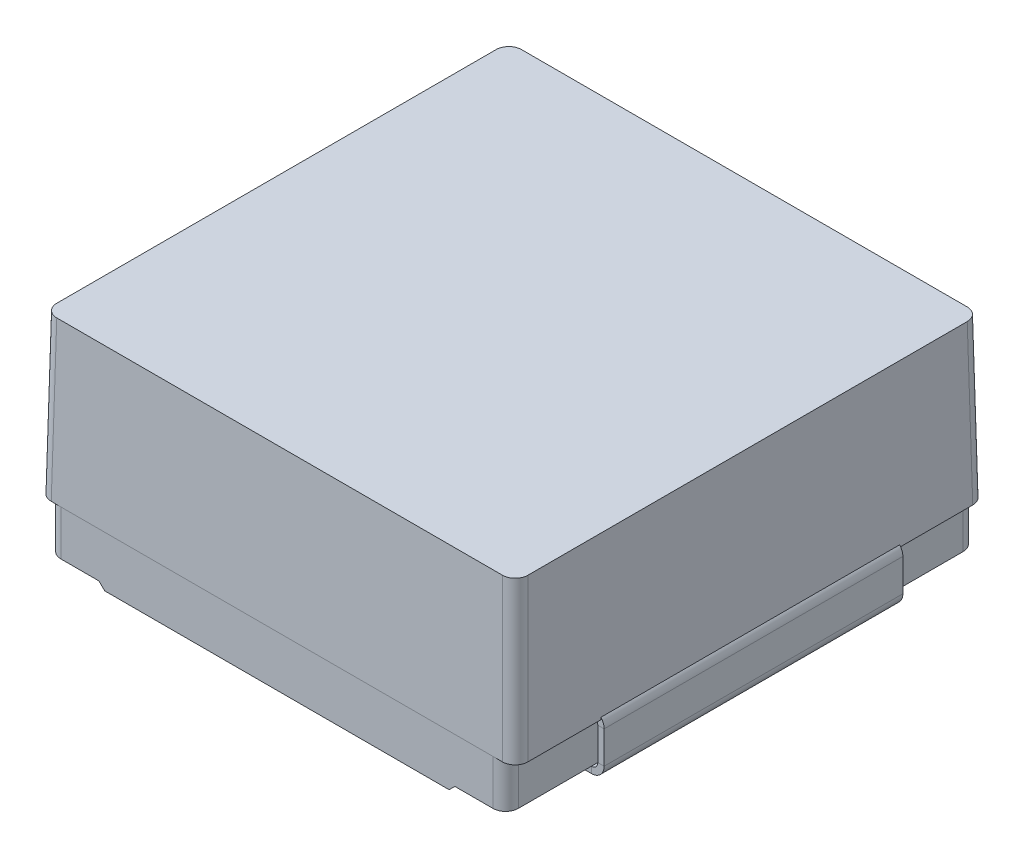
ISO-10303-21;
HEADER;
FILE_DESCRIPTION(('STEP AP214'),'2;1');
FILE_NAME('part.step','',(''),(''),'','','');
FILE_SCHEMA(('AUTOMOTIVE_DESIGN { 1 0 10303 214 1 1 1 1 }'));
ENDSEC;
DATA;
#1=APPLICATION_CONTEXT('core data for automotive mechanical design processes');
#2=APPLICATION_PROTOCOL_DEFINITION('international standard','automotive_design',2000,#1);
#3=PRODUCT_CONTEXT('',#1,'mechanical');
#4=PRODUCT('Part','Part','',(#3));
#5=PRODUCT_RELATED_PRODUCT_CATEGORY('part','',(#4));
#6=PRODUCT_DEFINITION_FORMATION('','',#4);
#7=PRODUCT_DEFINITION_CONTEXT('part definition',#1,'design');
#8=PRODUCT_DEFINITION('design','',#6,#7);
#9=PRODUCT_DEFINITION_SHAPE('','',#8);
#10=(LENGTH_UNIT() NAMED_UNIT(*) SI_UNIT(.MILLI.,.METRE.));
#11=(NAMED_UNIT(*) PLANE_ANGLE_UNIT() SI_UNIT($,.RADIAN.));
#12=(NAMED_UNIT(*) SI_UNIT($,.STERADIAN.) SOLID_ANGLE_UNIT());
#13=UNCERTAINTY_MEASURE_WITH_UNIT(LENGTH_MEASURE(1.E-05),#10,'distance_accuracy_value','');
#14=(GEOMETRIC_REPRESENTATION_CONTEXT(3) GLOBAL_UNCERTAINTY_ASSIGNED_CONTEXT((#13)) GLOBAL_UNIT_ASSIGNED_CONTEXT((#10,
#11,#12)) REPRESENTATION_CONTEXT('',''));
#15=CARTESIAN_POINT('',(0.,0.,0.));
#16=DIRECTION('',(0.,0.,1.));
#17=DIRECTION('',(1.,0.,0.));
#18=AXIS2_PLACEMENT_3D('',#15,#16,#17);
#19=CARTESIAN_POINT('',(-57.4937292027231,19.3065945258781,27.1607744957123));
#20=DIRECTION('',(1.,0.,0.));
#21=DIRECTION('',(0.,0.,1.));
#22=AXIS2_PLACEMENT_3D('',#19,#20,#21);
#23=PLANE('',#22);
#24=DIRECTION('',(0.,-1.,0.));
#25=VECTOR('',#24,1.);
#26=CARTESIAN_POINT('',(-57.4937292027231,19.3065945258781,21.1917744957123));
#27=LINE('',#26,#25);
#28=CARTESIAN_POINT('',(-57.4937292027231,8.27029452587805,21.1917744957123));
#29=VERTEX_POINT('',#28);
#30=CARTESIAN_POINT('',(-57.4937292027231,9.56412112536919,21.1917744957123));
#31=VERTEX_POINT('',#30);
#32=EDGE_CURVE('P0_E33',#29,#31,#27,.F.);
#33=ORIENTED_EDGE('',*,*,#32,.F.);
#34=DIRECTION('',(0.,0.,1.));
#35=VECTOR('',#34,1.);
#36=CARTESIAN_POINT('',(-57.4937292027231,8.27029452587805,27.1607744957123));
#37=LINE('',#36,#35);
#38=CARTESIAN_POINT('',(-57.4937292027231,8.27029452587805,33.1297744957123));
#39=VERTEX_POINT('',#38);
#40=EDGE_CURVE('P0_E25',#29,#39,#37,.T.);
#41=ORIENTED_EDGE('',*,*,#40,.T.);
#42=DIRECTION('',(0.,-1.,0.));
#43=VECTOR('',#42,1.);
#44=CARTESIAN_POINT('',(-57.4937292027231,19.3065945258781,33.1297744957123));
#45=LINE('',#44,#43);
#46=CARTESIAN_POINT('',(-57.4937292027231,9.56412112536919,33.1297744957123));
#47=VERTEX_POINT('',#46);
#48=EDGE_CURVE('P0_E41',#47,#39,#45,.T.);
#49=ORIENTED_EDGE('',*,*,#48,.F.);
#50=DIRECTION('',(0.,0.,-1.));
#51=VECTOR('',#50,1.);
#52=CARTESIAN_POINT('',(-57.4937292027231,9.56412112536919,27.1607744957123));
#53=LINE('',#52,#51);
#54=EDGE_CURVE('P0_E252',#47,#31,#53,.T.);
#55=ORIENTED_EDGE('',*,*,#54,.T.);
#56=EDGE_LOOP('',(#33,#41,#49,#55));
#57=FACE_BOUND('',#56,.T.);
#58=ADVANCED_FACE('P0_F16',(#57),#23,.F.);
#59=CARTESIAN_POINT('',(-76.2897292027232,19.3065945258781,27.1607744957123));
#60=DIRECTION('',(-1.,0.,0.));
#61=DIRECTION('',(0.,0.,1.));
#62=AXIS2_PLACEMENT_3D('',#59,#60,#61);
#63=PLANE('',#62);
#64=DIRECTION('',(0.,1.,0.));
#65=VECTOR('',#64,1.);
#66=CARTESIAN_POINT('',(-76.2897292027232,19.3065945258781,33.1297744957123));
#67=LINE('',#66,#65);
#68=CARTESIAN_POINT('',(-76.2897292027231,8.27029452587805,33.1297744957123));
#69=VERTEX_POINT('',#68);
#70=CARTESIAN_POINT('',(-76.2897292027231,9.56412112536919,33.1297744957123));
#71=VERTEX_POINT('',#70);
#72=EDGE_CURVE('P0_E326',#69,#71,#67,.T.);
#73=ORIENTED_EDGE('',*,*,#72,.F.);
#74=DIRECTION('',(0.,0.,-1.));
#75=VECTOR('',#74,1.);
#76=CARTESIAN_POINT('',(-76.2897292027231,8.27029452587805,27.1607744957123));
#77=LINE('',#76,#75);
#78=CARTESIAN_POINT('',(-76.2897292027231,8.27029452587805,21.1917744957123));
#79=VERTEX_POINT('',#78);
#80=EDGE_CURVE('P0_E338',#69,#79,#77,.T.);
#81=ORIENTED_EDGE('',*,*,#80,.T.);
#82=DIRECTION('',(0.,1.,0.));
#83=VECTOR('',#82,1.);
#84=CARTESIAN_POINT('',(-76.2897292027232,19.3065945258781,21.1917744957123));
#85=LINE('',#84,#83);
#86=CARTESIAN_POINT('',(-76.2897292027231,9.56412112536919,21.1917744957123));
#87=VERTEX_POINT('',#86);
#88=EDGE_CURVE('P0_E346',#87,#79,#85,.F.);
#89=ORIENTED_EDGE('',*,*,#88,.F.);
#90=DIRECTION('',(0.,0.,-1.));
#91=VECTOR('',#90,1.);
#92=CARTESIAN_POINT('',(-76.2897292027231,9.5641211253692,27.1607744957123));
#93=LINE('',#92,#91);
#94=EDGE_CURVE('P0_E308',#71,#87,#93,.T.);
#95=ORIENTED_EDGE('',*,*,#94,.F.);
#96=EDGE_LOOP('',(#73,#81,#89,#95));
#97=FACE_BOUND('',#96,.T.);
#98=ADVANCED_FACE('P0_F420',(#97),#63,.F.);
#99=CARTESIAN_POINT('',(-53.6202292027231,10.0721211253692,21.1917744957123));
#100=DIRECTION('',(0.,0.,-1.));
#101=DIRECTION('',(-1.,0.,0.));
#102=AXIS2_PLACEMENT_3D('',#99,#100,#101);
#103=PLANE('',#102);
#104=DIRECTION('',(-1.,0.,0.));
#105=VECTOR('',#104,1.);
#106=CARTESIAN_POINT('',(-53.6202292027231,10.0721211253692,21.1917744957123));
#107=LINE('',#106,#105);
#108=CARTESIAN_POINT('',(-57.7477292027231,10.0721211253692,21.1917744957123));
#109=VERTEX_POINT('',#108);
#110=CARTESIAN_POINT('',(-76.0357292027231,10.0721211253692,21.1917744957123));
#111=VERTEX_POINT('',#110);
#112=EDGE_CURVE('P0_E329',#109,#111,#107,.T.);
#113=ORIENTED_EDGE('',*,*,#112,.F.);
#114=DIRECTION('',(0.,-1.,0.));
#115=VECTOR('',#114,1.);
#116=CARTESIAN_POINT('',(-57.7477292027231,10.0721211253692,21.1917744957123));
#117=LINE('',#116,#115);
#118=CARTESIAN_POINT('',(-57.7477292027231,9.8181211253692,21.1917744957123));
#119=VERTEX_POINT('',#118);
#120=EDGE_CURVE('P0_E321',#109,#119,#117,.T.);
#121=ORIENTED_EDGE('',*,*,#120,.T.);
#122=DIRECTION('',(1.,0.,0.));
#123=VECTOR('',#122,1.);
#124=CARTESIAN_POINT('',(-66.8917292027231,9.8181211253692,21.1917744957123));
#125=LINE('',#124,#123);
#126=CARTESIAN_POINT('',(-76.0357292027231,9.8181211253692,21.1917744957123));
#127=VERTEX_POINT('',#126);
#128=EDGE_CURVE('P0_E290',#119,#127,#125,.F.);
#129=ORIENTED_EDGE('',*,*,#128,.T.);
#130=DIRECTION('',(0.,-1.,0.));
#131=VECTOR('',#130,1.);
#132=CARTESIAN_POINT('',(-76.0357292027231,10.0721211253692,21.1917744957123));
#133=LINE('',#132,#131);
#134=EDGE_CURVE('P0_E296',#111,#127,#133,.T.);
#135=ORIENTED_EDGE('',*,*,#134,.F.);
#136=EDGE_LOOP('',(#113,#121,#129,#135));
#137=FACE_BOUND('',#136,.T.);
#138=ADVANCED_FACE('P0_F374',(#137),#103,.T.);
#139=CARTESIAN_POINT('',(-53.6202292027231,10.0721211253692,33.1297744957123));
#140=DIRECTION('',(0.,0.,1.));
#141=DIRECTION('',(1.,0.,0.));
#142=AXIS2_PLACEMENT_3D('',#139,#140,#141);
#143=PLANE('',#142);
#144=DIRECTION('',(1.,0.,0.));
#145=VECTOR('',#144,1.);
#146=CARTESIAN_POINT('',(-66.8917292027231,9.8181211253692,33.1297744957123));
#147=LINE('',#146,#145);
#148=CARTESIAN_POINT('',(-76.0357292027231,9.8181211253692,33.1297744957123));
#149=VERTEX_POINT('',#148);
#150=CARTESIAN_POINT('',(-57.7477292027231,9.8181211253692,33.1297744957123));
#151=VERTEX_POINT('',#150);
#152=EDGE_CURVE('P0_E291',#149,#151,#147,.T.);
#153=ORIENTED_EDGE('',*,*,#152,.T.);
#154=DIRECTION('',(0.,1.,0.));
#155=VECTOR('',#154,1.);
#156=CARTESIAN_POINT('',(-57.7477292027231,10.0721211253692,33.1297744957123));
#157=LINE('',#156,#155);
#158=CARTESIAN_POINT('',(-57.7477292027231,10.0721211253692,33.1297744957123));
#159=VERTEX_POINT('',#158);
#160=EDGE_CURVE('P0_E316',#151,#159,#157,.T.);
#161=ORIENTED_EDGE('',*,*,#160,.T.);
#162=DIRECTION('',(1.,0.,0.));
#163=VECTOR('',#162,1.);
#164=CARTESIAN_POINT('',(-53.6202292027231,10.0721211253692,33.1297744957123));
#165=LINE('',#164,#163);
#166=CARTESIAN_POINT('',(-76.0357292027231,10.0721211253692,33.1297744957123));
#167=VERTEX_POINT('',#166);
#168=EDGE_CURVE('P0_E295',#167,#159,#165,.T.);
#169=ORIENTED_EDGE('',*,*,#168,.F.);
#170=DIRECTION('',(0.,1.,0.));
#171=VECTOR('',#170,1.);
#172=CARTESIAN_POINT('',(-76.0357292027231,10.0721211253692,33.1297744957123));
#173=LINE('',#172,#171);
#174=EDGE_CURVE('P0_E292',#149,#167,#173,.T.);
#175=ORIENTED_EDGE('',*,*,#174,.F.);
#176=EDGE_LOOP('',(#153,#161,#169,#175));
#177=FACE_BOUND('',#176,.T.);
#178=ADVANCED_FACE('P0_F381',(#177),#143,.T.);
#179=CARTESIAN_POINT('',(-66.8917292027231,10.0721211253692,27.1607744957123));
#180=DIRECTION('',(0.,1.,0.));
#181=DIRECTION('',(0.,0.,1.));
#182=AXIS2_PLACEMENT_3D('',#179,#180,#181);
#183=PLANE('',#182);
#184=ORIENTED_EDGE('',*,*,#168,.T.);
#185=DIRECTION('',(0.,0.,-1.));
#186=VECTOR('',#185,1.);
#187=CARTESIAN_POINT('',(-57.7477292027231,10.0721211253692,27.1607744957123));
#188=LINE('',#187,#186);
#189=EDGE_CURVE('P0_E313',#159,#109,#188,.T.);
#190=ORIENTED_EDGE('',*,*,#189,.T.);
#191=ORIENTED_EDGE('',*,*,#112,.T.);
#192=DIRECTION('',(0.,0.,-1.));
#193=VECTOR('',#192,1.);
#194=CARTESIAN_POINT('',(-76.0357292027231,10.0721211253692,27.1607744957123));
#195=LINE('',#194,#193);
#196=EDGE_CURVE('P0_E282',#167,#111,#195,.T.);
#197=ORIENTED_EDGE('',*,*,#196,.F.);
#198=EDGE_LOOP('',(#184,#190,#191,#197));
#199=FACE_BOUND('',#198,.T.);
#200=ADVANCED_FACE('P0_F378',(#199),#183,.T.);
#201=CARTESIAN_POINT('',(-76.5437292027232,32.5780945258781,21.1917744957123));
#202=DIRECTION('',(0.,0.,-1.));
#203=DIRECTION('',(0.,-1.,0.));
#204=AXIS2_PLACEMENT_3D('',#201,#202,#203);
#205=PLANE('',#204);
#206=DIRECTION('',(1.,0.,0.));
#207=VECTOR('',#206,1.);
#208=CARTESIAN_POINT('',(-76.5437292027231,8.27029452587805,21.1917744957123));
#209=LINE('',#208,#207);
#210=CARTESIAN_POINT('',(-76.5437292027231,8.27029452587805,21.1917744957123));
#211=VERTEX_POINT('',#210);
#212=EDGE_CURVE('P0_E335',#211,#79,#209,.T.);
#213=ORIENTED_EDGE('',*,*,#212,.F.);
#214=DIRECTION('',(0.,-1.,0.));
#215=VECTOR('',#214,1.);
#216=CARTESIAN_POINT('',(-76.5437292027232,32.5780945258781,21.1917744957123));
#217=LINE('',#216,#215);
#218=CARTESIAN_POINT('',(-76.5437292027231,9.56412112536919,21.1917744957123));
#219=VERTEX_POINT('',#218);
#220=EDGE_CURVE('P0_E305',#219,#211,#217,.T.);
#221=ORIENTED_EDGE('',*,*,#220,.F.);
#222=DIRECTION('',(1.,0.,0.));
#223=VECTOR('',#222,1.);
#224=CARTESIAN_POINT('',(-76.5437292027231,9.56412112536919,21.1917744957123));
#225=LINE('',#224,#223);
#226=EDGE_CURVE('P0_E310',#219,#87,#225,.T.);
#227=ORIENTED_EDGE('',*,*,#226,.T.);
#228=ORIENTED_EDGE('',*,*,#88,.T.);
#229=EDGE_LOOP('',(#213,#221,#227,#228));
#230=FACE_BOUND('',#229,.T.);
#231=ADVANCED_FACE('P0_F434',(#230),#205,.T.);
#232=CARTESIAN_POINT('',(-76.5437292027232,32.5780945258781,33.1297744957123));
#233=DIRECTION('',(0.,0.,1.));
#234=DIRECTION('',(0.,1.,0.));
#235=AXIS2_PLACEMENT_3D('',#232,#233,#234);
#236=PLANE('',#235);
#237=DIRECTION('',(-1.,0.,0.));
#238=VECTOR('',#237,1.);
#239=CARTESIAN_POINT('',(-76.5437292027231,8.27029452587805,33.1297744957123));
#240=LINE('',#239,#238);
#241=CARTESIAN_POINT('',(-76.5437292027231,8.27029452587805,33.1297744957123));
#242=VERTEX_POINT('',#241);
#243=EDGE_CURVE('P0_E341',#69,#242,#240,.T.);
#244=ORIENTED_EDGE('',*,*,#243,.F.);
#245=ORIENTED_EDGE('',*,*,#72,.T.);
#246=DIRECTION('',(-1.,0.,0.));
#247=VECTOR('',#246,1.);
#248=CARTESIAN_POINT('',(-76.5437292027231,9.56412112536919,33.1297744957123));
#249=LINE('',#248,#247);
#250=CARTESIAN_POINT('',(-76.5437292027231,9.56412112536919,33.1297744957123));
#251=VERTEX_POINT('',#250);
#252=EDGE_CURVE('P0_E304',#71,#251,#249,.T.);
#253=ORIENTED_EDGE('',*,*,#252,.T.);
#254=DIRECTION('',(0.,1.,0.));
#255=VECTOR('',#254,1.);
#256=CARTESIAN_POINT('',(-76.5437292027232,32.5780945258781,33.1297744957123));
#257=LINE('',#256,#255);
#258=EDGE_CURVE('P0_E348',#242,#251,#257,.T.);
#259=ORIENTED_EDGE('',*,*,#258,.F.);
#260=EDGE_LOOP('',(#244,#245,#253,#259));
#261=FACE_BOUND('',#260,.T.);
#262=ADVANCED_FACE('P0_F431',(#261),#236,.T.);
#263=CARTESIAN_POINT('',(-76.5437292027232,19.3065945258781,27.1607744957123));
#264=DIRECTION('',(-1.,0.,0.));
#265=DIRECTION('',(0.,0.,1.));
#266=AXIS2_PLACEMENT_3D('',#263,#264,#265);
#267=PLANE('',#266);
#268=DIRECTION('',(0.,0.,-1.));
#269=VECTOR('',#268,1.);
#270=CARTESIAN_POINT('',(-76.5437292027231,8.27029452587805,27.1607744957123));
#271=LINE('',#270,#269);
#272=EDGE_CURVE('P0_E324',#242,#211,#271,.T.);
#273=ORIENTED_EDGE('',*,*,#272,.F.);
#274=ORIENTED_EDGE('',*,*,#258,.T.);
#275=DIRECTION('',(0.,0.,-1.));
#276=VECTOR('',#275,1.);
#277=CARTESIAN_POINT('',(-76.5437292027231,9.56412112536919,27.1607744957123));
#278=LINE('',#277,#276);
#279=EDGE_CURVE('P0_E301',#251,#219,#278,.T.);
#280=ORIENTED_EDGE('',*,*,#279,.T.);
#281=ORIENTED_EDGE('',*,*,#220,.T.);
#282=EDGE_LOOP('',(#273,#274,#280,#281));
#283=FACE_BOUND('',#282,.T.);
#284=ADVANCED_FACE('P0_F433',(#283),#267,.T.);
#285=CARTESIAN_POINT('',(-66.8917292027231,9.8181211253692,27.1607744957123));
#286=DIRECTION('',(0.,1.,0.));
#287=DIRECTION('',(0.,0.,1.));
#288=AXIS2_PLACEMENT_3D('',#285,#286,#287);
#289=PLANE('',#288);
#290=DIRECTION('',(0.,0.,-1.));
#291=VECTOR('',#290,1.);
#292=CARTESIAN_POINT('',(-57.7477292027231,9.8181211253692,27.1607744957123));
#293=LINE('',#292,#291);
#294=EDGE_CURVE('P0_E319',#151,#119,#293,.T.);
#295=ORIENTED_EDGE('',*,*,#294,.F.);
#296=ORIENTED_EDGE('',*,*,#152,.F.);
#297=DIRECTION('',(0.,0.,-1.));
#298=VECTOR('',#297,1.);
#299=CARTESIAN_POINT('',(-76.0357292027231,9.8181211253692,27.1607744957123));
#300=LINE('',#299,#298);
#301=EDGE_CURVE('P0_E287',#149,#127,#300,.T.);
#302=ORIENTED_EDGE('',*,*,#301,.T.);
#303=ORIENTED_EDGE('',*,*,#128,.F.);
#304=EDGE_LOOP('',(#295,#296,#302,#303));
#305=FACE_BOUND('',#304,.T.);
#306=ADVANCED_FACE('P0_F442',(#305),#289,.F.);
#307=CARTESIAN_POINT('',(-76.0357292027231,9.56412112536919,33.1297744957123));
#308=DIRECTION('',(0.,0.,1.));
#309=DIRECTION('',(1.,0.,0.));
#310=AXIS2_PLACEMENT_3D('',#307,#308,#309);
#311=PLANE('',#310);
#312=ORIENTED_EDGE('',*,*,#252,.F.);
#313=CARTESIAN_POINT('',(-76.0357292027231,9.56412112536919,33.1297744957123));
#314=DIRECTION('',(0.,0.,1.));
#315=DIRECTION('',(1.,0.,0.));
#316=AXIS2_PLACEMENT_3D('',#313,#314,#315);
#317=CIRCLE('',#316,0.254);
#318=EDGE_CURVE('P0_E270',#71,#149,#317,.F.);
#319=ORIENTED_EDGE('',*,*,#318,.T.);
#320=ORIENTED_EDGE('',*,*,#174,.T.);
#321=CARTESIAN_POINT('',(-76.0357292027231,9.56412112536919,33.1297744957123));
#322=DIRECTION('',(0.,0.,-1.));
#323=DIRECTION('',(-1.,0.,0.));
#324=AXIS2_PLACEMENT_3D('',#321,#322,#323);
#325=CIRCLE('',#324,0.508);
#326=EDGE_CURVE('P0_E276',#251,#167,#325,.T.);
#327=ORIENTED_EDGE('',*,*,#326,.F.);
#328=EDGE_LOOP('',(#312,#319,#320,#327));
#329=FACE_BOUND('',#328,.T.);
#330=ADVANCED_FACE('P0_F448',(#329),#311,.T.);
#331=CARTESIAN_POINT('',(-76.0357292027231,9.56412112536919,21.1917744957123));
#332=DIRECTION('',(0.,0.,-1.));
#333=DIRECTION('',(-1.,0.,0.));
#334=AXIS2_PLACEMENT_3D('',#331,#332,#333);
#335=PLANE('',#334);
#336=CARTESIAN_POINT('',(-76.0357292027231,9.56412112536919,21.1917744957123));
#337=DIRECTION('',(0.,0.,1.));
#338=DIRECTION('',(1.,0.,0.));
#339=AXIS2_PLACEMENT_3D('',#336,#337,#338);
#340=CIRCLE('',#339,0.254);
#341=EDGE_CURVE('P0_E280',#127,#87,#340,.T.);
#342=ORIENTED_EDGE('',*,*,#341,.T.);
#343=ORIENTED_EDGE('',*,*,#226,.F.);
#344=CARTESIAN_POINT('',(-76.0357292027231,9.56412112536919,21.1917744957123));
#345=DIRECTION('',(0.,0.,1.));
#346=DIRECTION('',(1.,0.,0.));
#347=AXIS2_PLACEMENT_3D('',#344,#345,#346);
#348=CIRCLE('',#347,0.508);
#349=EDGE_CURVE('P0_E279',#111,#219,#348,.T.);
#350=ORIENTED_EDGE('',*,*,#349,.F.);
#351=ORIENTED_EDGE('',*,*,#134,.T.);
#352=EDGE_LOOP('',(#342,#343,#350,#351));
#353=FACE_BOUND('',#352,.T.);
#354=ADVANCED_FACE('P0_F454',(#353),#335,.T.);
#355=CARTESIAN_POINT('',(-76.0357292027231,9.56412112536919,15.2050842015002));
#356=DIRECTION('',(0.,0.,1.));
#357=DIRECTION('',(1.,0.,0.));
#358=AXIS2_PLACEMENT_3D('',#355,#356,#357);
#359=CYLINDRICAL_SURFACE('',#358,0.508);
#360=ORIENTED_EDGE('',*,*,#196,.T.);
#361=ORIENTED_EDGE('',*,*,#349,.T.);
#362=ORIENTED_EDGE('',*,*,#279,.F.);
#363=ORIENTED_EDGE('',*,*,#326,.T.);
#364=EDGE_LOOP('',(#360,#361,#362,#363));
#365=FACE_BOUND('',#364,.T.);
#366=ADVANCED_FACE('P0_F457',(#365),#359,.T.);
#367=CARTESIAN_POINT('',(-76.0357292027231,9.56412112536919,15.2050842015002));
#368=DIRECTION('',(0.,0.,1.));
#369=DIRECTION('',(1.,0.,0.));
#370=AXIS2_PLACEMENT_3D('',#367,#368,#369);
#371=CYLINDRICAL_SURFACE('',#370,0.254);
#372=ORIENTED_EDGE('',*,*,#301,.F.);
#373=ORIENTED_EDGE('',*,*,#318,.F.);
#374=ORIENTED_EDGE('',*,*,#94,.T.);
#375=ORIENTED_EDGE('',*,*,#341,.F.);
#376=EDGE_LOOP('',(#372,#373,#374,#375));
#377=FACE_BOUND('',#376,.T.);
#378=ADVANCED_FACE('P0_F462',(#377),#371,.F.);
#379=CARTESIAN_POINT('',(-57.7477292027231,9.56412112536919,33.1297744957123));
#380=DIRECTION('',(0.,0.,1.));
#381=DIRECTION('',(1.,0.,0.));
#382=AXIS2_PLACEMENT_3D('',#379,#380,#381);
#383=PLANE('',#382);
#384=ORIENTED_EDGE('',*,*,#160,.F.);
#385=CARTESIAN_POINT('',(-57.7477292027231,9.56412112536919,33.1297744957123));
#386=DIRECTION('',(0.,0.,-1.));
#387=DIRECTION('',(-1.,0.,0.));
#388=AXIS2_PLACEMENT_3D('',#385,#386,#387);
#389=CIRCLE('',#388,0.254);
#390=EDGE_CURVE('P0_E273',#151,#47,#389,.T.);
#391=ORIENTED_EDGE('',*,*,#390,.T.);
#392=DIRECTION('',(1.,0.,0.));
#393=VECTOR('',#392,1.);
#394=CARTESIAN_POINT('',(-57.2397292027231,9.56412112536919,33.1297744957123));
#395=LINE('',#394,#393);
#396=CARTESIAN_POINT('',(-57.2397292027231,9.56412112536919,33.1297744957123));
#397=VERTEX_POINT('',#396);
#398=EDGE_CURVE('P0_E254',#47,#397,#395,.T.);
#399=ORIENTED_EDGE('',*,*,#398,.T.);
#400=CARTESIAN_POINT('',(-57.7477292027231,9.56412112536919,33.1297744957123));
#401=DIRECTION('',(0.,0.,-1.));
#402=DIRECTION('',(-1.,0.,0.));
#403=AXIS2_PLACEMENT_3D('',#400,#401,#402);
#404=CIRCLE('',#403,0.508000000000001);
#405=EDGE_CURVE('P0_E263',#159,#397,#404,.T.);
#406=ORIENTED_EDGE('',*,*,#405,.F.);
#407=EDGE_LOOP('',(#384,#391,#399,#406));
#408=FACE_BOUND('',#407,.T.);
#409=ADVANCED_FACE('P0_F385',(#408),#383,.T.);
#410=CARTESIAN_POINT('',(-57.7477292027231,9.56412112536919,21.1917744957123));
#411=DIRECTION('',(0.,0.,-1.));
#412=DIRECTION('',(-1.,0.,0.));
#413=AXIS2_PLACEMENT_3D('',#410,#411,#412);
#414=PLANE('',#413);
#415=DIRECTION('',(-1.,0.,0.));
#416=VECTOR('',#415,1.);
#417=CARTESIAN_POINT('',(-57.2397292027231,9.56412112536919,21.1917744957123));
#418=LINE('',#417,#416);
#419=CARTESIAN_POINT('',(-57.2397292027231,9.56412112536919,21.1917744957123));
#420=VERTEX_POINT('',#419);
#421=EDGE_CURVE('P0_E258',#420,#31,#418,.T.);
#422=ORIENTED_EDGE('',*,*,#421,.T.);
#423=CARTESIAN_POINT('',(-57.7477292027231,9.56412112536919,21.1917744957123));
#424=DIRECTION('',(0.,0.,-1.));
#425=DIRECTION('',(-1.,0.,0.));
#426=AXIS2_PLACEMENT_3D('',#423,#424,#425);
#427=CIRCLE('',#426,0.254);
#428=EDGE_CURVE('P0_E267',#31,#119,#427,.F.);
#429=ORIENTED_EDGE('',*,*,#428,.T.);
#430=ORIENTED_EDGE('',*,*,#120,.F.);
#431=CARTESIAN_POINT('',(-57.7477292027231,9.56412112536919,21.1917744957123));
#432=DIRECTION('',(0.,0.,1.));
#433=DIRECTION('',(1.,0.,0.));
#434=AXIS2_PLACEMENT_3D('',#431,#432,#433);
#435=CIRCLE('',#434,0.508);
#436=EDGE_CURVE('P0_E266',#420,#109,#435,.T.);
#437=ORIENTED_EDGE('',*,*,#436,.F.);
#438=EDGE_LOOP('',(#422,#429,#430,#437));
#439=FACE_BOUND('',#438,.T.);
#440=ADVANCED_FACE('P0_F370',(#439),#414,.T.);
#441=CARTESIAN_POINT('',(-57.7477292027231,9.56412112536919,39.1164647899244));
#442=DIRECTION('',(0.,0.,-1.));
#443=DIRECTION('',(-1.,0.,0.));
#444=AXIS2_PLACEMENT_3D('',#441,#442,#443);
#445=CYLINDRICAL_SURFACE('',#444,0.508);
#446=ORIENTED_EDGE('',*,*,#436,.T.);
#447=ORIENTED_EDGE('',*,*,#189,.F.);
#448=ORIENTED_EDGE('',*,*,#405,.T.);
#449=DIRECTION('',(0.,0.,-1.));
#450=VECTOR('',#449,1.);
#451=CARTESIAN_POINT('',(-57.2397292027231,9.56412112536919,27.1607744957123));
#452=LINE('',#451,#450);
#453=EDGE_CURVE('P0_E247',#397,#420,#452,.T.);
#454=ORIENTED_EDGE('',*,*,#453,.T.);
#455=EDGE_LOOP('',(#446,#447,#448,#454));
#456=FACE_BOUND('',#455,.T.);
#457=ADVANCED_FACE('P0_F368',(#456),#445,.T.);
#458=CARTESIAN_POINT('',(-57.7477292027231,9.56412112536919,39.1164647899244));
#459=DIRECTION('',(0.,0.,-1.));
#460=DIRECTION('',(-1.,0.,0.));
#461=AXIS2_PLACEMENT_3D('',#458,#459,#460);
#462=CYLINDRICAL_SURFACE('',#461,0.254);
#463=ORIENTED_EDGE('',*,*,#428,.F.);
#464=ORIENTED_EDGE('',*,*,#54,.F.);
#465=ORIENTED_EDGE('',*,*,#390,.F.);
#466=ORIENTED_EDGE('',*,*,#294,.T.);
#467=EDGE_LOOP('',(#463,#464,#465,#466));
#468=FACE_BOUND('',#467,.T.);
#469=ADVANCED_FACE('P0_F388',(#468),#462,.F.);
#470=CARTESIAN_POINT('',(-57.2397292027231,19.3065945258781,27.1607744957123));
#471=DIRECTION('',(1.,0.,0.));
#472=DIRECTION('',(0.,0.,1.));
#473=AXIS2_PLACEMENT_3D('',#470,#471,#472);
#474=PLANE('',#473);
#475=DIRECTION('',(0.,0.,1.));
#476=VECTOR('',#475,1.);
#477=CARTESIAN_POINT('',(-57.2397292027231,8.27029452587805,27.1607744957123));
#478=LINE('',#477,#476);
#479=CARTESIAN_POINT('',(-57.2397292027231,8.27029452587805,21.1917744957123));
#480=VERTEX_POINT('',#479);
#481=CARTESIAN_POINT('',(-57.2397292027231,8.27029452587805,33.1297744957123));
#482=VERTEX_POINT('',#481);
#483=EDGE_CURVE('P0_E344',#480,#482,#478,.T.);
#484=ORIENTED_EDGE('',*,*,#483,.F.);
#485=DIRECTION('',(0.,1.,0.));
#486=VECTOR('',#485,1.);
#487=CARTESIAN_POINT('',(-57.2397292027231,6.03509452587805,21.1917744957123));
#488=LINE('',#487,#486);
#489=EDGE_CURVE('P0_E20',#480,#420,#488,.T.);
#490=ORIENTED_EDGE('',*,*,#489,.T.);
#491=ORIENTED_EDGE('',*,*,#453,.F.);
#492=DIRECTION('',(0.,-1.,0.));
#493=VECTOR('',#492,1.);
#494=CARTESIAN_POINT('',(-57.2397292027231,6.03509452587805,33.1297744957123));
#495=LINE('',#494,#493);
#496=EDGE_CURVE('P0_E257',#397,#482,#495,.T.);
#497=ORIENTED_EDGE('',*,*,#496,.T.);
#498=EDGE_LOOP('',(#484,#490,#491,#497));
#499=FACE_BOUND('',#498,.T.);
#500=ADVANCED_FACE('P0_F362',(#499),#474,.T.);
#501=CARTESIAN_POINT('',(-57.2397292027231,6.03509452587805,33.1297744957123));
#502=DIRECTION('',(0.,0.,1.));
#503=DIRECTION('',(0.,-1.,0.));
#504=AXIS2_PLACEMENT_3D('',#501,#502,#503);
#505=PLANE('',#504);
#506=DIRECTION('',(-1.,0.,0.));
#507=VECTOR('',#506,1.);
#508=CARTESIAN_POINT('',(-57.2397292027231,8.27029452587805,33.1297744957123));
#509=LINE('',#508,#507);
#510=EDGE_CURVE('P0_E353',#482,#39,#509,.T.);
#511=ORIENTED_EDGE('',*,*,#510,.F.);
#512=ORIENTED_EDGE('',*,*,#496,.F.);
#513=ORIENTED_EDGE('',*,*,#398,.F.);
#514=ORIENTED_EDGE('',*,*,#48,.T.);
#515=EDGE_LOOP('',(#511,#512,#513,#514));
#516=FACE_BOUND('',#515,.T.);
#517=ADVANCED_FACE('P0_F390',(#516),#505,.T.);
#518=CARTESIAN_POINT('',(-57.2397292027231,6.03509452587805,21.1917744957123));
#519=DIRECTION('',(0.,0.,-1.));
#520=DIRECTION('',(0.,1.,0.));
#521=AXIS2_PLACEMENT_3D('',#518,#519,#520);
#522=PLANE('',#521);
#523=DIRECTION('',(1.,0.,0.));
#524=VECTOR('',#523,1.);
#525=CARTESIAN_POINT('',(-57.2397292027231,8.27029452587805,21.1917744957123));
#526=LINE('',#525,#524);
#527=EDGE_CURVE('P0_E10',#29,#480,#526,.T.);
#528=ORIENTED_EDGE('',*,*,#527,.F.);
#529=ORIENTED_EDGE('',*,*,#32,.T.);
#530=ORIENTED_EDGE('',*,*,#421,.F.);
#531=ORIENTED_EDGE('',*,*,#489,.F.);
#532=EDGE_LOOP('',(#528,#529,#530,#531));
#533=FACE_BOUND('',#532,.T.);
#534=ADVANCED_FACE('P0_F18',(#533),#522,.T.);
#535=CARTESIAN_POINT('',(-76.0357292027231,8.27029452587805,33.1297744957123));
#536=DIRECTION('',(0.,0.,1.));
#537=DIRECTION('',(1.,0.,0.));
#538=AXIS2_PLACEMENT_3D('',#535,#536,#537);
#539=PLANE('',#538);
#540=DIRECTION('',(0.,-1.,0.));
#541=VECTOR('',#540,1.);
#542=CARTESIAN_POINT('',(-76.0357292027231,7.76229452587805,33.1297744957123));
#543=LINE('',#542,#541);
#544=CARTESIAN_POINT('',(-76.0357292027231,8.01629452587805,33.1297744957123));
#545=VERTEX_POINT('',#544);
#546=CARTESIAN_POINT('',(-76.0357292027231,7.76229452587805,33.1297744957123));
#547=VERTEX_POINT('',#546);
#548=EDGE_CURVE('P0_E210',#545,#547,#543,.T.);
#549=ORIENTED_EDGE('',*,*,#548,.F.);
#550=CARTESIAN_POINT('',(-76.0357292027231,8.27029452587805,33.1297744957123));
#551=DIRECTION('',(0.,0.,1.));
#552=DIRECTION('',(1.,0.,0.));
#553=AXIS2_PLACEMENT_3D('',#550,#551,#552);
#554=CIRCLE('',#553,0.254);
#555=EDGE_CURVE('P0_E212',#545,#69,#554,.F.);
#556=ORIENTED_EDGE('',*,*,#555,.T.);
#557=ORIENTED_EDGE('',*,*,#243,.T.);
#558=CARTESIAN_POINT('',(-76.0357292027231,8.27029452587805,33.1297744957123));
#559=DIRECTION('',(0.,0.,-1.));
#560=DIRECTION('',(-1.,0.,0.));
#561=AXIS2_PLACEMENT_3D('',#558,#559,#560);
#562=CIRCLE('',#561,0.508);
#563=EDGE_CURVE('P0_E240',#547,#242,#562,.T.);
#564=ORIENTED_EDGE('',*,*,#563,.F.);
#565=EDGE_LOOP('',(#549,#556,#557,#564));
#566=FACE_BOUND('',#565,.T.);
#567=ADVANCED_FACE('P0_F481',(#566),#539,.T.);
#568=CARTESIAN_POINT('',(-76.0357292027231,8.27029452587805,21.1917744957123));
#569=DIRECTION('',(0.,0.,-1.));
#570=DIRECTION('',(-1.,0.,0.));
#571=AXIS2_PLACEMENT_3D('',#568,#569,#570);
#572=PLANE('',#571);
#573=CARTESIAN_POINT('',(-76.0357292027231,8.27029452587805,21.1917744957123));
#574=DIRECTION('',(0.,0.,1.));
#575=DIRECTION('',(1.,0.,0.));
#576=AXIS2_PLACEMENT_3D('',#573,#574,#575);
#577=CIRCLE('',#576,0.254);
#578=CARTESIAN_POINT('',(-76.0357292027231,8.01629452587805,21.1917744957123));
#579=VERTEX_POINT('',#578);
#580=EDGE_CURVE('P0_E244',#79,#579,#577,.T.);
#581=ORIENTED_EDGE('',*,*,#580,.T.);
#582=DIRECTION('',(0.,1.,0.));
#583=VECTOR('',#582,1.);
#584=CARTESIAN_POINT('',(-76.0357292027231,7.76229452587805,21.1917744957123));
#585=LINE('',#584,#583);
#586=CARTESIAN_POINT('',(-76.0357292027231,7.76229452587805,21.1917744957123));
#587=VERTEX_POINT('',#586);
#588=EDGE_CURVE('P0_E220',#587,#579,#585,.T.);
#589=ORIENTED_EDGE('',*,*,#588,.F.);
#590=CARTESIAN_POINT('',(-76.0357292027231,8.27029452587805,21.1917744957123));
#591=DIRECTION('',(0.,0.,1.));
#592=DIRECTION('',(1.,0.,0.));
#593=AXIS2_PLACEMENT_3D('',#590,#591,#592);
#594=CIRCLE('',#593,0.508);
#595=EDGE_CURVE('P0_E243',#211,#587,#594,.T.);
#596=ORIENTED_EDGE('',*,*,#595,.F.);
#597=ORIENTED_EDGE('',*,*,#212,.T.);
#598=EDGE_LOOP('',(#581,#589,#596,#597));
#599=FACE_BOUND('',#598,.T.);
#600=ADVANCED_FACE('P0_F477',(#599),#572,.T.);
#601=CARTESIAN_POINT('',(-76.0357292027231,8.27029452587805,15.2050842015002));
#602=DIRECTION('',(0.,0.,1.));
#603=DIRECTION('',(1.,0.,0.));
#604=AXIS2_PLACEMENT_3D('',#601,#602,#603);
#605=CYLINDRICAL_SURFACE('',#604,0.508);
#606=ORIENTED_EDGE('',*,*,#272,.T.);
#607=ORIENTED_EDGE('',*,*,#595,.T.);
#608=DIRECTION('',(0.,0.,-1.));
#609=VECTOR('',#608,1.);
#610=CARTESIAN_POINT('',(-76.0357292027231,7.76229452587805,27.1607744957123));
#611=LINE('',#610,#609);
#612=EDGE_CURVE('P0_E228',#547,#587,#611,.T.);
#613=ORIENTED_EDGE('',*,*,#612,.F.);
#614=ORIENTED_EDGE('',*,*,#563,.T.);
#615=EDGE_LOOP('',(#606,#607,#613,#614));
#616=FACE_BOUND('',#615,.T.);
#617=ADVANCED_FACE('P0_F480',(#616),#605,.T.);
#618=CARTESIAN_POINT('',(-76.0357292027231,8.27029452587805,15.2050842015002));
#619=DIRECTION('',(0.,0.,1.));
#620=DIRECTION('',(1.,0.,0.));
#621=AXIS2_PLACEMENT_3D('',#618,#619,#620);
#622=CYLINDRICAL_SURFACE('',#621,0.254);
#623=ORIENTED_EDGE('',*,*,#80,.F.);
#624=ORIENTED_EDGE('',*,*,#555,.F.);
#625=DIRECTION('',(0.,0.,-1.));
#626=VECTOR('',#625,1.);
#627=CARTESIAN_POINT('',(-76.0357292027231,8.01629452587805,27.1607744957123));
#628=LINE('',#627,#626);
#629=EDGE_CURVE('P0_E205',#545,#579,#628,.T.);
#630=ORIENTED_EDGE('',*,*,#629,.T.);
#631=ORIENTED_EDGE('',*,*,#580,.F.);
#632=EDGE_LOOP('',(#623,#624,#630,#631));
#633=FACE_BOUND('',#632,.T.);
#634=ADVANCED_FACE('P0_F486',(#633),#622,.F.);
#635=CARTESIAN_POINT('',(-74.399002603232,7.76229452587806,33.1297744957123));
#636=DIRECTION('',(1.,0.,0.));
#637=DIRECTION('',(0.,0.,1.));
#638=AXIS2_PLACEMENT_3D('',#635,#636,#637);
#639=PLANE('',#638);
#640=DIRECTION('',(0.,-1.,0.));
#641=VECTOR('',#640,1.);
#642=CARTESIAN_POINT('',(-74.399002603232,7.76229452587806,21.1917744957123));
#643=LINE('',#642,#641);
#644=CARTESIAN_POINT('',(-74.399002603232,8.01629452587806,21.1917744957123));
#645=VERTEX_POINT('',#644);
#646=CARTESIAN_POINT('',(-74.399002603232,7.76229452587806,21.1917744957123));
#647=VERTEX_POINT('',#646);
#648=EDGE_CURVE('P0_E215',#645,#647,#643,.T.);
#649=ORIENTED_EDGE('',*,*,#648,.F.);
#650=DIRECTION('',(0.,0.,1.));
#651=VECTOR('',#650,1.);
#652=CARTESIAN_POINT('',(-74.399002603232,8.01629452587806,27.1607744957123));
#653=LINE('',#652,#651);
#654=CARTESIAN_POINT('',(-74.399002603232,8.01629452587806,33.1297744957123));
#655=VERTEX_POINT('',#654);
#656=EDGE_CURVE('P0_E235',#645,#655,#653,.T.);
#657=ORIENTED_EDGE('',*,*,#656,.T.);
#658=DIRECTION('',(0.,-1.,0.));
#659=VECTOR('',#658,1.);
#660=CARTESIAN_POINT('',(-74.399002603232,7.76229452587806,33.1297744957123));
#661=LINE('',#660,#659);
#662=CARTESIAN_POINT('',(-74.399002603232,7.76229452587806,33.1297744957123));
#663=VERTEX_POINT('',#662);
#664=EDGE_CURVE('P0_E233',#655,#663,#661,.T.);
#665=ORIENTED_EDGE('',*,*,#664,.T.);
#666=DIRECTION('',(0.,0.,1.));
#667=VECTOR('',#666,1.);
#668=CARTESIAN_POINT('',(-74.399002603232,7.76229452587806,33.1297744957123));
#669=LINE('',#668,#667);
#670=EDGE_CURVE('P0_E223',#647,#663,#669,.T.);
#671=ORIENTED_EDGE('',*,*,#670,.F.);
#672=EDGE_LOOP('',(#649,#657,#665,#671));
#673=FACE_BOUND('',#672,.T.);
#674=ADVANCED_FACE('P0_F489',(#673),#639,.T.);
#675=CARTESIAN_POINT('',(-87.670502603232,7.76229452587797,27.1607744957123));
#676=DIRECTION('',(0.,-1.,0.));
#677=DIRECTION('',(0.,0.,1.));
#678=AXIS2_PLACEMENT_3D('',#675,#676,#677);
#679=PLANE('',#678);
#680=DIRECTION('',(-1.,0.,0.));
#681=VECTOR('',#680,1.);
#682=CARTESIAN_POINT('',(-100.942002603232,7.76229452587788,33.1297744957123));
#683=LINE('',#682,#681);
#684=EDGE_CURVE('P0_E230',#663,#547,#683,.T.);
#685=ORIENTED_EDGE('',*,*,#684,.T.);
#686=ORIENTED_EDGE('',*,*,#612,.T.);
#687=DIRECTION('',(1.,0.,0.));
#688=VECTOR('',#687,1.);
#689=CARTESIAN_POINT('',(-100.942002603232,7.76229452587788,21.1917744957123));
#690=LINE('',#689,#688);
#691=EDGE_CURVE('P0_E226',#587,#647,#690,.T.);
#692=ORIENTED_EDGE('',*,*,#691,.T.);
#693=ORIENTED_EDGE('',*,*,#670,.T.);
#694=EDGE_LOOP('',(#685,#686,#692,#693));
#695=FACE_BOUND('',#694,.T.);
#696=ADVANCED_FACE('P0_F505',(#695),#679,.T.);
#697=CARTESIAN_POINT('',(-100.942002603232,7.76229452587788,21.1917744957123));
#698=DIRECTION('',(0.,0.,-1.));
#699=DIRECTION('',(1.,0.,0.));
#700=AXIS2_PLACEMENT_3D('',#697,#698,#699);
#701=PLANE('',#700);
#702=ORIENTED_EDGE('',*,*,#691,.F.);
#703=ORIENTED_EDGE('',*,*,#588,.T.);
#704=DIRECTION('',(-1.,0.,0.));
#705=VECTOR('',#704,1.);
#706=CARTESIAN_POINT('',(-87.670502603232,8.01629452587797,21.1917744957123));
#707=LINE('',#706,#705);
#708=EDGE_CURVE('P0_E218',#579,#645,#707,.F.);
#709=ORIENTED_EDGE('',*,*,#708,.T.);
#710=ORIENTED_EDGE('',*,*,#648,.T.);
#711=EDGE_LOOP('',(#702,#703,#709,#710));
#712=FACE_BOUND('',#711,.T.);
#713=ADVANCED_FACE('P0_F501',(#712),#701,.T.);
#714=CARTESIAN_POINT('',(-87.670502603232,8.01629452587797,27.1607744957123));
#715=DIRECTION('',(0.,-1.,0.));
#716=DIRECTION('',(0.,0.,1.));
#717=AXIS2_PLACEMENT_3D('',#714,#715,#716);
#718=PLANE('',#717);
#719=ORIENTED_EDGE('',*,*,#629,.F.);
#720=DIRECTION('',(-1.,0.,0.));
#721=VECTOR('',#720,1.);
#722=CARTESIAN_POINT('',(-87.670502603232,8.01629452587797,33.1297744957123));
#723=LINE('',#722,#721);
#724=EDGE_CURVE('P0_E213',#655,#545,#723,.T.);
#725=ORIENTED_EDGE('',*,*,#724,.F.);
#726=ORIENTED_EDGE('',*,*,#656,.F.);
#727=ORIENTED_EDGE('',*,*,#708,.F.);
#728=EDGE_LOOP('',(#719,#725,#726,#727));
#729=FACE_BOUND('',#728,.T.);
#730=ADVANCED_FACE('P0_F497',(#729),#718,.F.);
#731=CARTESIAN_POINT('',(-100.942002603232,7.76229452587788,33.1297744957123));
#732=DIRECTION('',(0.,0.,1.));
#733=DIRECTION('',(-1.,0.,0.));
#734=AXIS2_PLACEMENT_3D('',#731,#732,#733);
#735=PLANE('',#734);
#736=ORIENTED_EDGE('',*,*,#724,.T.);
#737=ORIENTED_EDGE('',*,*,#548,.T.);
#738=ORIENTED_EDGE('',*,*,#684,.F.);
#739=ORIENTED_EDGE('',*,*,#664,.F.);
#740=EDGE_LOOP('',(#736,#737,#738,#739));
#741=FACE_BOUND('',#740,.T.);
#742=ADVANCED_FACE('P0_F494',(#741),#735,.T.);
#743=CARTESIAN_POINT('',(-57.7477292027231,8.27029452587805,21.1917744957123));
#744=DIRECTION('',(0.,0.,-1.));
#745=DIRECTION('',(-1.,0.,0.));
#746=AXIS2_PLACEMENT_3D('',#743,#744,#745);
#747=PLANE('',#746);
#748=DIRECTION('',(0.,-1.,0.));
#749=VECTOR('',#748,1.);
#750=CARTESIAN_POINT('',(-57.7477292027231,7.76229452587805,21.1917744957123));
#751=LINE('',#750,#749);
#752=CARTESIAN_POINT('',(-57.7477292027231,8.01629452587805,21.1917744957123));
#753=VERTEX_POINT('',#752);
#754=CARTESIAN_POINT('',(-57.7477292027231,7.76229452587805,21.1917744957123));
#755=VERTEX_POINT('',#754);
#756=EDGE_CURVE('P0_E179',#753,#755,#751,.T.);
#757=ORIENTED_EDGE('',*,*,#756,.F.);
#758=CARTESIAN_POINT('',(-57.7477292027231,8.27029452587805,21.1917744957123));
#759=DIRECTION('',(0.,0.,-1.));
#760=DIRECTION('',(-1.,0.,0.));
#761=AXIS2_PLACEMENT_3D('',#758,#759,#760);
#762=CIRCLE('',#761,0.254);
#763=EDGE_CURVE('P0_E181',#753,#29,#762,.F.);
#764=ORIENTED_EDGE('',*,*,#763,.T.);
#765=ORIENTED_EDGE('',*,*,#527,.T.);
#766=CARTESIAN_POINT('',(-57.7477292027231,8.27029452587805,21.1917744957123));
#767=DIRECTION('',(0.,0.,1.));
#768=DIRECTION('',(1.,0.,0.));
#769=AXIS2_PLACEMENT_3D('',#766,#767,#768);
#770=CIRCLE('',#769,0.508);
#771=EDGE_CURVE('P0_E198',#755,#480,#770,.T.);
#772=ORIENTED_EDGE('',*,*,#771,.F.);
#773=EDGE_LOOP('',(#757,#764,#765,#772));
#774=FACE_BOUND('',#773,.T.);
#775=ADVANCED_FACE('P0_F407',(#774),#747,.T.);
#776=CARTESIAN_POINT('',(-57.7477292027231,8.27029452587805,33.1297744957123));
#777=DIRECTION('',(0.,0.,1.));
#778=DIRECTION('',(1.,0.,0.));
#779=AXIS2_PLACEMENT_3D('',#776,#777,#778);
#780=PLANE('',#779);
#781=CARTESIAN_POINT('',(-57.7477292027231,8.27029452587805,33.1297744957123));
#782=DIRECTION('',(0.,0.,-1.));
#783=DIRECTION('',(-1.,0.,0.));
#784=AXIS2_PLACEMENT_3D('',#781,#782,#783);
#785=CIRCLE('',#784,0.254);
#786=CARTESIAN_POINT('',(-57.7477292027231,8.01629452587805,33.1297744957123));
#787=VERTEX_POINT('',#786);
#788=EDGE_CURVE('P0_E202',#39,#787,#785,.T.);
#789=ORIENTED_EDGE('',*,*,#788,.T.);
#790=DIRECTION('',(0.,1.,0.));
#791=VECTOR('',#790,1.);
#792=CARTESIAN_POINT('',(-57.7477292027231,7.76229452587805,33.1297744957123));
#793=LINE('',#792,#791);
#794=CARTESIAN_POINT('',(-57.7477292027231,7.76229452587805,33.1297744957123));
#795=VERTEX_POINT('',#794);
#796=EDGE_CURVE('P0_E187',#795,#787,#793,.T.);
#797=ORIENTED_EDGE('',*,*,#796,.F.);
#798=CARTESIAN_POINT('',(-57.7477292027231,8.27029452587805,33.1297744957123));
#799=DIRECTION('',(0.,0.,-1.));
#800=DIRECTION('',(-1.,0.,0.));
#801=AXIS2_PLACEMENT_3D('',#798,#799,#800);
#802=CIRCLE('',#801,0.508000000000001);
#803=EDGE_CURVE('P0_E201',#482,#795,#802,.T.);
#804=ORIENTED_EDGE('',*,*,#803,.F.);
#805=ORIENTED_EDGE('',*,*,#510,.T.);
#806=EDGE_LOOP('',(#789,#797,#804,#805));
#807=FACE_BOUND('',#806,.T.);
#808=ADVANCED_FACE('P0_F399',(#807),#780,.T.);
#809=CARTESIAN_POINT('',(-57.7477292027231,8.27029452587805,39.1164647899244));
#810=DIRECTION('',(0.,0.,-1.));
#811=DIRECTION('',(-1.,0.,0.));
#812=AXIS2_PLACEMENT_3D('',#809,#810,#811);
#813=CYLINDRICAL_SURFACE('',#812,0.508);
#814=ORIENTED_EDGE('',*,*,#483,.T.);
#815=ORIENTED_EDGE('',*,*,#803,.T.);
#816=DIRECTION('',(0.,0.,1.));
#817=VECTOR('',#816,1.);
#818=CARTESIAN_POINT('',(-57.7477292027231,7.76229452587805,27.1607744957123));
#819=LINE('',#818,#817);
#820=EDGE_CURVE('P0_E194',#755,#795,#819,.T.);
#821=ORIENTED_EDGE('',*,*,#820,.F.);
#822=ORIENTED_EDGE('',*,*,#771,.T.);
#823=EDGE_LOOP('',(#814,#815,#821,#822));
#824=FACE_BOUND('',#823,.T.);
#825=ADVANCED_FACE('P0_F395',(#824),#813,.T.);
#826=CARTESIAN_POINT('',(-57.7477292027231,8.27029452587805,39.1164647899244));
#827=DIRECTION('',(0.,0.,-1.));
#828=DIRECTION('',(-1.,0.,0.));
#829=AXIS2_PLACEMENT_3D('',#826,#827,#828);
#830=CYLINDRICAL_SURFACE('',#829,0.254);
#831=ORIENTED_EDGE('',*,*,#40,.F.);
#832=ORIENTED_EDGE('',*,*,#763,.F.);
#833=DIRECTION('',(0.,0.,1.));
#834=VECTOR('',#833,1.);
#835=CARTESIAN_POINT('',(-57.7477292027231,8.01629452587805,27.1607744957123));
#836=LINE('',#835,#834);
#837=EDGE_CURVE('P0_E174',#753,#787,#836,.T.);
#838=ORIENTED_EDGE('',*,*,#837,.T.);
#839=ORIENTED_EDGE('',*,*,#788,.F.);
#840=EDGE_LOOP('',(#831,#832,#838,#839));
#841=FACE_BOUND('',#840,.T.);
#842=ADVANCED_FACE('P0_F405',(#841),#830,.F.);
#843=CARTESIAN_POINT('',(-59.3844558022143,7.76229452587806,33.1297744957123));
#844=DIRECTION('',(-1.,0.,0.));
#845=DIRECTION('',(0.,0.,-1.));
#846=AXIS2_PLACEMENT_3D('',#843,#844,#845);
#847=PLANE('',#846);
#848=DIRECTION('',(0.,-1.,0.));
#849=VECTOR('',#848,1.);
#850=CARTESIAN_POINT('',(-59.3844558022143,7.76229452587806,33.1297744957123));
#851=LINE('',#850,#849);
#852=CARTESIAN_POINT('',(-59.3844558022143,8.01629452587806,33.1297744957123));
#853=VERTEX_POINT('',#852);
#854=CARTESIAN_POINT('',(-59.3844558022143,7.76229452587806,33.1297744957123));
#855=VERTEX_POINT('',#854);
#856=EDGE_CURVE('P0_E172',#853,#855,#851,.T.);
#857=ORIENTED_EDGE('',*,*,#856,.F.);
#858=DIRECTION('',(0.,0.,1.));
#859=VECTOR('',#858,1.);
#860=CARTESIAN_POINT('',(-59.3844558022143,8.01629452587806,27.1607744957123));
#861=LINE('',#860,#859);
#862=CARTESIAN_POINT('',(-59.3844558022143,8.01629452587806,21.1917744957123));
#863=VERTEX_POINT('',#862);
#864=EDGE_CURVE('P0_E166',#853,#863,#861,.F.);
#865=ORIENTED_EDGE('',*,*,#864,.T.);
#866=DIRECTION('',(0.,-1.,0.));
#867=VECTOR('',#866,1.);
#868=CARTESIAN_POINT('',(-59.3844558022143,7.76229452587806,21.1917744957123));
#869=LINE('',#868,#867);
#870=CARTESIAN_POINT('',(-59.3844558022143,7.76229452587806,21.1917744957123));
#871=VERTEX_POINT('',#870);
#872=EDGE_CURVE('P0_E155',#863,#871,#869,.T.);
#873=ORIENTED_EDGE('',*,*,#872,.T.);
#874=DIRECTION('',(0.,0.,-1.));
#875=VECTOR('',#874,1.);
#876=CARTESIAN_POINT('',(-59.3844558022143,7.76229452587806,33.1297744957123));
#877=LINE('',#876,#875);
#878=EDGE_CURVE('P0_E190',#855,#871,#877,.T.);
#879=ORIENTED_EDGE('',*,*,#878,.F.);
#880=EDGE_LOOP('',(#857,#865,#873,#879));
#881=FACE_BOUND('',#880,.T.);
#882=ADVANCED_FACE('P0_F170',(#881),#847,.T.);
#883=CARTESIAN_POINT('',(-46.1129558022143,7.76229452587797,27.1607744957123));
#884=DIRECTION('',(0.,-1.,0.));
#885=DIRECTION('',(0.,0.,1.));
#886=AXIS2_PLACEMENT_3D('',#883,#884,#885);
#887=PLANE('',#886);
#888=DIRECTION('',(1.,0.,0.));
#889=VECTOR('',#888,1.);
#890=CARTESIAN_POINT('',(-59.3844558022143,7.76229452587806,21.1917744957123));
#891=LINE('',#890,#889);
#892=EDGE_CURVE('P0_E162',#871,#755,#891,.T.);
#893=ORIENTED_EDGE('',*,*,#892,.T.);
#894=ORIENTED_EDGE('',*,*,#820,.T.);
#895=DIRECTION('',(-1.,0.,0.));
#896=VECTOR('',#895,1.);
#897=CARTESIAN_POINT('',(-59.3844558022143,7.76229452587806,33.1297744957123));
#898=LINE('',#897,#896);
#899=EDGE_CURVE('P0_E192',#795,#855,#898,.T.);
#900=ORIENTED_EDGE('',*,*,#899,.T.);
#901=ORIENTED_EDGE('',*,*,#878,.T.);
#902=EDGE_LOOP('',(#893,#894,#900,#901));
#903=FACE_BOUND('',#902,.T.);
#904=ADVANCED_FACE('P0_F409',(#903),#887,.T.);
#905=CARTESIAN_POINT('',(-59.3844558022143,7.76229452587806,33.1297744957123));
#906=DIRECTION('',(0.,0.,1.));
#907=DIRECTION('',(-1.,0.,0.));
#908=AXIS2_PLACEMENT_3D('',#905,#906,#907);
#909=PLANE('',#908);
#910=ORIENTED_EDGE('',*,*,#899,.F.);
#911=ORIENTED_EDGE('',*,*,#796,.T.);
#912=DIRECTION('',(-1.,0.,0.));
#913=VECTOR('',#912,1.);
#914=CARTESIAN_POINT('',(-46.1129558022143,8.01629452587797,33.1297744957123));
#915=LINE('',#914,#913);
#916=EDGE_CURVE('P0_E183',#787,#853,#915,.T.);
#917=ORIENTED_EDGE('',*,*,#916,.T.);
#918=ORIENTED_EDGE('',*,*,#856,.T.);
#919=EDGE_LOOP('',(#910,#911,#917,#918));
#920=FACE_BOUND('',#919,.T.);
#921=ADVANCED_FACE('P0_F402',(#920),#909,.T.);
#922=CARTESIAN_POINT('',(-46.1129558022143,8.01629452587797,27.1607744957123));
#923=DIRECTION('',(0.,-1.,0.));
#924=DIRECTION('',(0.,0.,1.));
#925=AXIS2_PLACEMENT_3D('',#922,#923,#924);
#926=PLANE('',#925);
#927=ORIENTED_EDGE('',*,*,#837,.F.);
#928=DIRECTION('',(-1.,0.,0.));
#929=VECTOR('',#928,1.);
#930=CARTESIAN_POINT('',(-46.1129558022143,8.01629452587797,21.1917744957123));
#931=LINE('',#930,#929);
#932=EDGE_CURVE('P0_E159',#863,#753,#931,.F.);
#933=ORIENTED_EDGE('',*,*,#932,.F.);
#934=ORIENTED_EDGE('',*,*,#864,.F.);
#935=ORIENTED_EDGE('',*,*,#916,.F.);
#936=EDGE_LOOP('',(#927,#933,#934,#935));
#937=FACE_BOUND('',#936,.T.);
#938=ADVANCED_FACE('P0_F176',(#937),#926,.F.);
#939=CARTESIAN_POINT('',(-59.3844558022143,7.76229452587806,21.1917744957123));
#940=DIRECTION('',(0.,0.,-1.));
#941=DIRECTION('',(1.,0.,0.));
#942=AXIS2_PLACEMENT_3D('',#939,#940,#941);
#943=PLANE('',#942);
#944=ORIENTED_EDGE('',*,*,#932,.T.);
#945=ORIENTED_EDGE('',*,*,#756,.T.);
#946=ORIENTED_EDGE('',*,*,#892,.F.);
#947=ORIENTED_EDGE('',*,*,#872,.F.);
#948=EDGE_LOOP('',(#944,#945,#946,#947));
#949=FACE_BOUND('',#948,.T.);
#950=ADVANCED_FACE('P0_F157',(#949),#943,.T.);
#951=CLOSED_SHELL('',(#58,#98,#138,#178,#200,#231,#262,#284,#306,#330,#354,#366,#378,#409,#440,
#457,#469,#500,#517,#534,#567,#600,#617,#634,#674,#696,#713,#730,#742,#775,#808,#825,#842,#882,
#904,#921,#938,#950));
#952=MANIFOLD_SOLID_BREP('P0_B1',#951);
#953=CARTESIAN_POINT('',(-76.0357292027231,9.8181211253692,36.5587744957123));
#954=DIRECTION('',(-0.999999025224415,-0.00139626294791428,0.));
#955=DIRECTION('',(0.00139626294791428,-0.999999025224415,0.));
#956=AXIS2_PLACEMENT_3D('',#953,#954,#955);
#957=PLANE('',#956);
#958=DIRECTION('',(0.,0.,1.));
#959=VECTOR('',#958,1.);
#960=CARTESIAN_POINT('',(-76.0332111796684,8.0147211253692,36.5587744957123));
#961=LINE('',#960,#959);
#962=CARTESIAN_POINT('',(-76.0332111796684,8.0147211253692,18.2732920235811));
#963=VERTEX_POINT('',#962);
#964=CARTESIAN_POINT('',(-76.0332111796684,8.0147211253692,36.0482569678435));
#965=VERTEX_POINT('',#964);
#966=EDGE_CURVE('P1_E198',#963,#965,#961,.T.);
#967=ORIENTED_EDGE('',*,*,#966,.T.);
#968=DIRECTION('',(-0.0013962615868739,0.999998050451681,0.0013962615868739));
#969=VECTOR('',#968,1.);
#970=CARTESIAN_POINT('',(-76.0357301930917,9.8188304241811,36.0507759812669));
#971=LINE('',#970,#969);
#972=CARTESIAN_POINT('',(-76.0357292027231,9.8181211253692,36.0507749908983));
#973=VERTEX_POINT('',#972);
#974=EDGE_CURVE('P1_E242',#965,#973,#971,.T.);
#975=ORIENTED_EDGE('',*,*,#974,.T.);
#976=DIRECTION('',(0.,0.,1.));
#977=VECTOR('',#976,1.);
#978=CARTESIAN_POINT('',(-76.0357292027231,9.8181211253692,36.5587744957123));
#979=LINE('',#978,#977);
#980=CARTESIAN_POINT('',(-76.0357292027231,9.8181211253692,18.2707740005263));
#981=VERTEX_POINT('',#980);
#982=EDGE_CURVE('P1_E204',#981,#973,#979,.T.);
#983=ORIENTED_EDGE('',*,*,#982,.F.);
#984=DIRECTION('',(-0.0013962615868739,0.999998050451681,-0.0013962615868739));
#985=VECTOR('',#984,1.);
#986=CARTESIAN_POINT('',(-76.0356935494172,9.79258634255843,18.2708096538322));
#987=LINE('',#986,#985);
#988=EDGE_CURVE('P1_E240',#981,#963,#987,.F.);
#989=ORIENTED_EDGE('',*,*,#988,.T.);
#990=EDGE_LOOP('',(#967,#975,#983,#989));
#991=FACE_BOUND('',#990,.T.);
#992=ADVANCED_FACE('P1_F17',(#991),#957,.T.);
#993=CARTESIAN_POINT('',(-57.7477292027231,9.8181211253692,36.5587744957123));
#994=DIRECTION('',(0.999999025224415,-0.00139626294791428,0.));
#995=DIRECTION('',(0.00139626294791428,0.999999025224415,0.));
#996=AXIS2_PLACEMENT_3D('',#993,#994,#995);
#997=PLANE('',#996);
#998=DIRECTION('',(0.,0.,-1.));
#999=VECTOR('',#998,1.);
#1000=CARTESIAN_POINT('',(-57.7477292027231,9.8181211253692,36.5587744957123));
#1001=LINE('',#1000,#999);
#1002=CARTESIAN_POINT('',(-57.7477292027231,9.8181211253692,36.0507749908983));
#1003=VERTEX_POINT('',#1002);
#1004=CARTESIAN_POINT('',(-57.7477292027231,9.8181211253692,18.2707740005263));
#1005=VERTEX_POINT('',#1004);
#1006=EDGE_CURVE('P1_E210',#1003,#1005,#1001,.T.);
#1007=ORIENTED_EDGE('',*,*,#1006,.F.);
#1008=DIRECTION('',(0.0013962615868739,0.999998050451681,0.0013962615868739));
#1009=VECTOR('',#1008,1.);
#1010=CARTESIAN_POINT('',(-57.7477282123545,9.8188304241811,36.0507759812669));
#1011=LINE('',#1010,#1009);
#1012=CARTESIAN_POINT('',(-57.7502472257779,8.0147211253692,36.0482569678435));
#1013=VERTEX_POINT('',#1012);
#1014=EDGE_CURVE('P1_E235',#1003,#1013,#1011,.F.);
#1015=ORIENTED_EDGE('',*,*,#1014,.T.);
#1016=DIRECTION('',(0.,0.,-1.));
#1017=VECTOR('',#1016,1.);
#1018=CARTESIAN_POINT('',(-57.7502472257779,8.0147211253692,36.5587744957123));
#1019=LINE('',#1018,#1017);
#1020=CARTESIAN_POINT('',(-57.7502472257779,8.0147211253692,18.2732920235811));
#1021=VERTEX_POINT('',#1020);
#1022=EDGE_CURVE('P1_E188',#1013,#1021,#1019,.T.);
#1023=ORIENTED_EDGE('',*,*,#1022,.T.);
#1024=DIRECTION('',(0.0013962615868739,0.999998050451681,-0.0013962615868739));
#1025=VECTOR('',#1024,1.);
#1026=CARTESIAN_POINT('',(-57.747764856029,9.79258634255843,18.2708096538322));
#1027=LINE('',#1026,#1025);
#1028=EDGE_CURVE('P1_E232',#1021,#1005,#1027,.T.);
#1029=ORIENTED_EDGE('',*,*,#1028,.T.);
#1030=EDGE_LOOP('',(#1007,#1015,#1023,#1029));
#1031=FACE_BOUND('',#1030,.T.);
#1032=ADVANCED_FACE('P1_F378',(#1031),#997,.T.);
#1033=CARTESIAN_POINT('',(-57.7477292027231,9.8181211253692,17.7627744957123));
#1034=DIRECTION('',(0.,-0.00139626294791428,-0.999999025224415));
#1035=DIRECTION('',(0.,0.999999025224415,-0.00139626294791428));
#1036=AXIS2_PLACEMENT_3D('',#1033,#1034,#1035);
#1037=PLANE('',#1036);
#1038=DIRECTION('',(-1.,0.,0.));
#1039=VECTOR('',#1038,1.);
#1040=CARTESIAN_POINT('',(-57.7477292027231,8.0147211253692,17.7652925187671));
#1041=LINE('',#1040,#1039);
#1042=CARTESIAN_POINT('',(-74.0037292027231,8.0147211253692,17.7652925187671));
#1043=VERTEX_POINT('',#1042);
#1044=CARTESIAN_POINT('',(-75.5252116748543,8.0147211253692,17.7652925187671));
#1045=VERTEX_POINT('',#1044);
#1046=EDGE_CURVE('P1_E201',#1043,#1045,#1041,.T.);
#1047=ORIENTED_EDGE('',*,*,#1046,.T.);
#1048=DIRECTION('',(-0.0013962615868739,0.999998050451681,-0.0013962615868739));
#1049=VECTOR('',#1048,1.);
#1050=CARTESIAN_POINT('',(-75.5276950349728,9.79329564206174,17.7628091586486));
#1051=LINE('',#1050,#1049);
#1052=CARTESIAN_POINT('',(-75.5277296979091,9.8181211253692,17.7627744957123));
#1053=VERTEX_POINT('',#1052);
#1054=EDGE_CURVE('P1_E251',#1045,#1053,#1051,.T.);
#1055=ORIENTED_EDGE('',*,*,#1054,.T.);
#1056=DIRECTION('',(-1.,0.,0.));
#1057=VECTOR('',#1056,1.);
#1058=CARTESIAN_POINT('',(-57.7477292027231,9.8181211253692,17.7627744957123));
#1059=LINE('',#1058,#1057);
#1060=CARTESIAN_POINT('',(-58.2557287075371,9.8181211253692,17.7627744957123));
#1061=VERTEX_POINT('',#1060);
#1062=EDGE_CURVE('P1_E213',#1061,#1053,#1059,.T.);
#1063=ORIENTED_EDGE('',*,*,#1062,.F.);
#1064=DIRECTION('',(0.0013962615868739,0.999998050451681,-0.0013962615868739));
#1065=VECTOR('',#1064,1.);
#1066=CARTESIAN_POINT('',(-58.2557277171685,9.8188304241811,17.7627735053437));
#1067=LINE('',#1066,#1065);
#1068=CARTESIAN_POINT('',(-58.2582467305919,8.0147211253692,17.7652925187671));
#1069=VERTEX_POINT('',#1068);
#1070=EDGE_CURVE('P1_E249',#1061,#1069,#1067,.F.);
#1071=ORIENTED_EDGE('',*,*,#1070,.T.);
#1072=DIRECTION('',(-1.,0.,0.));
#1073=VECTOR('',#1072,1.);
#1074=CARTESIAN_POINT('',(-57.7477292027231,8.0147211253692,17.7652925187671));
#1075=LINE('',#1074,#1073);
#1076=CARTESIAN_POINT('',(-59.7797292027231,8.0147211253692,17.7652925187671));
#1077=VERTEX_POINT('',#1076);
#1078=EDGE_CURVE('P1_E196',#1069,#1077,#1075,.T.);
#1079=ORIENTED_EDGE('',*,*,#1078,.T.);
#1080=DIRECTION('',(0.707106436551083,0.707106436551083,-0.000987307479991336));
#1081=VECTOR('',#1080,1.);
#1082=CARTESIAN_POINT('',(-57.86202931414,9.93242101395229,17.7626149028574));
#1083=LINE('',#1082,#1081);
#1084=CARTESIAN_POINT('',(-60.0083292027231,7.78612112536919,17.7656117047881));
#1085=VERTEX_POINT('',#1084);
#1086=EDGE_CURVE('P1_E183',#1077,#1085,#1083,.F.);
#1087=ORIENTED_EDGE('',*,*,#1086,.T.);
#1088=DIRECTION('',(-1.,0.,0.));
#1089=VECTOR('',#1088,1.);
#1090=CARTESIAN_POINT('',(-66.8917292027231,7.78612112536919,17.7656117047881));
#1091=LINE('',#1090,#1089);
#1092=CARTESIAN_POINT('',(-73.7751292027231,7.78612112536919,17.7656117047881));
#1093=VERTEX_POINT('',#1092);
#1094=EDGE_CURVE('P1_E180',#1085,#1093,#1091,.T.);
#1095=ORIENTED_EDGE('',*,*,#1094,.T.);
#1096=DIRECTION('',(0.707106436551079,-0.707106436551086,0.000987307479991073));
#1097=VECTOR('',#1096,1.);
#1098=CARTESIAN_POINT('',(-66.7774380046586,0.788429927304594,17.7753823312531));
#1099=LINE('',#1098,#1097);
#1100=EDGE_CURVE('P1_E167',#1093,#1043,#1099,.F.);
#1101=ORIENTED_EDGE('',*,*,#1100,.T.);
#1102=EDGE_LOOP('',(#1047,#1055,#1063,#1071,#1079,#1087,#1095,#1101));
#1103=FACE_BOUND('',#1102,.T.);
#1104=ADVANCED_FACE('P1_F357',(#1103),#1037,.T.);
#1105=CARTESIAN_POINT('',(-57.7477292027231,9.8181211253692,36.5587744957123));
#1106=DIRECTION('',(0.,-0.00139626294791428,0.999999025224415));
#1107=DIRECTION('',(0.,-0.999999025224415,-0.00139626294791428));
#1108=AXIS2_PLACEMENT_3D('',#1105,#1106,#1107);
#1109=PLANE('',#1108);
#1110=DIRECTION('',(1.,0.,0.));
#1111=VECTOR('',#1110,1.);
#1112=CARTESIAN_POINT('',(-57.7477292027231,8.0147211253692,36.5562564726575));
#1113=LINE('',#1112,#1111);
#1114=CARTESIAN_POINT('',(-59.7797292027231,8.0147211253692,36.5562564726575));
#1115=VERTEX_POINT('',#1114);
#1116=CARTESIAN_POINT('',(-58.2582467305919,8.0147211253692,36.5562564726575));
#1117=VERTEX_POINT('',#1116);
#1118=EDGE_CURVE('P1_E159',#1115,#1117,#1113,.T.);
#1119=ORIENTED_EDGE('',*,*,#1118,.T.);
#1120=DIRECTION('',(0.0013962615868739,0.999998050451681,0.0013962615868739));
#1121=VECTOR('',#1120,1.);
#1122=CARTESIAN_POINT('',(-58.2557277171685,9.8188304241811,36.5587754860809));
#1123=LINE('',#1122,#1121);
#1124=CARTESIAN_POINT('',(-58.2557287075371,9.8181211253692,36.5587744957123));
#1125=VERTEX_POINT('',#1124);
#1126=EDGE_CURVE('P1_E230',#1117,#1125,#1123,.T.);
#1127=ORIENTED_EDGE('',*,*,#1126,.T.);
#1128=DIRECTION('',(1.,0.,0.));
#1129=VECTOR('',#1128,1.);
#1130=CARTESIAN_POINT('',(-57.7477292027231,9.8181211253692,36.5587744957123));
#1131=LINE('',#1130,#1129);
#1132=CARTESIAN_POINT('',(-75.5277296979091,9.8181211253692,36.5587744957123));
#1133=VERTEX_POINT('',#1132);
#1134=EDGE_CURVE('P1_E207',#1133,#1125,#1131,.T.);
#1135=ORIENTED_EDGE('',*,*,#1134,.F.);
#1136=DIRECTION('',(-0.0013962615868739,0.999998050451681,0.0013962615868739));
#1137=VECTOR('',#1136,1.);
#1138=CARTESIAN_POINT('',(-75.5276950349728,9.79329564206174,36.558739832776));
#1139=LINE('',#1138,#1137);
#1140=CARTESIAN_POINT('',(-75.5252116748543,8.0147211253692,36.5562564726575));
#1141=VERTEX_POINT('',#1140);
#1142=EDGE_CURVE('P1_E228',#1133,#1141,#1139,.F.);
#1143=ORIENTED_EDGE('',*,*,#1142,.T.);
#1144=DIRECTION('',(1.,0.,0.));
#1145=VECTOR('',#1144,1.);
#1146=CARTESIAN_POINT('',(-57.7477292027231,8.0147211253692,36.5562564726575));
#1147=LINE('',#1146,#1145);
#1148=CARTESIAN_POINT('',(-74.0037292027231,8.0147211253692,36.5562564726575));
#1149=VERTEX_POINT('',#1148);
#1150=EDGE_CURVE('P1_E179',#1141,#1149,#1147,.T.);
#1151=ORIENTED_EDGE('',*,*,#1150,.T.);
#1152=DIRECTION('',(-0.707106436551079,0.707106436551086,0.000987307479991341));
#1153=VECTOR('',#1152,1.);
#1154=CARTESIAN_POINT('',(-66.7774380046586,0.788429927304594,36.5461666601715));
#1155=LINE('',#1154,#1153);
#1156=CARTESIAN_POINT('',(-73.7751292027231,7.78612112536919,36.5559372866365));
#1157=VERTEX_POINT('',#1156);
#1158=EDGE_CURVE('P1_E168',#1149,#1157,#1155,.F.);
#1159=ORIENTED_EDGE('',*,*,#1158,.T.);
#1160=DIRECTION('',(1.,0.,0.));
#1161=VECTOR('',#1160,1.);
#1162=CARTESIAN_POINT('',(-66.8917292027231,7.78612112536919,36.5559372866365));
#1163=LINE('',#1162,#1161);
#1164=CARTESIAN_POINT('',(-60.0083292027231,7.78612112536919,36.5559372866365));
#1165=VERTEX_POINT('',#1164);
#1166=EDGE_CURVE('P1_E162',#1157,#1165,#1163,.T.);
#1167=ORIENTED_EDGE('',*,*,#1166,.T.);
#1168=DIRECTION('',(-0.707106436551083,-0.707106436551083,-0.000987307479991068));
#1169=VECTOR('',#1168,1.);
#1170=CARTESIAN_POINT('',(-57.86202931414,9.93242101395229,36.5589340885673));
#1171=LINE('',#1170,#1169);
#1172=EDGE_CURVE('P1_E155',#1165,#1115,#1171,.F.);
#1173=ORIENTED_EDGE('',*,*,#1172,.T.);
#1174=EDGE_LOOP('',(#1119,#1127,#1135,#1143,#1151,#1159,#1167,#1173));
#1175=FACE_BOUND('',#1174,.T.);
#1176=ADVANCED_FACE('P1_F157',(#1175),#1109,.T.);
#1177=CARTESIAN_POINT('',(-66.8917292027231,7.78612112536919,27.1607744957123));
#1178=DIRECTION('',(0.,1.,0.));
#1179=DIRECTION('',(0.,0.,1.));
#1180=AXIS2_PLACEMENT_3D('',#1177,#1178,#1179);
#1181=PLANE('',#1180);
#1182=ORIENTED_EDGE('',*,*,#1094,.F.);
#1183=DIRECTION('',(0.,0.,1.));
#1184=VECTOR('',#1183,1.);
#1185=CARTESIAN_POINT('',(-60.0083292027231,7.78612112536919,27.1607744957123));
#1186=LINE('',#1185,#1184);
#1187=EDGE_CURVE('P1_E223',#1085,#1165,#1186,.T.);
#1188=ORIENTED_EDGE('',*,*,#1187,.T.);
#1189=ORIENTED_EDGE('',*,*,#1166,.F.);
#1190=DIRECTION('',(0.,0.,-1.));
#1191=VECTOR('',#1190,1.);
#1192=CARTESIAN_POINT('',(-73.7751292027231,7.78612112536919,27.1607744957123));
#1193=LINE('',#1192,#1191);
#1194=EDGE_CURVE('P1_E220',#1157,#1093,#1193,.T.);
#1195=ORIENTED_EDGE('',*,*,#1194,.T.);
#1196=EDGE_LOOP('',(#1182,#1188,#1189,#1195));
#1197=FACE_BOUND('',#1196,.T.);
#1198=ADVANCED_FACE('P1_F366',(#1197),#1181,.F.);
#1199=CARTESIAN_POINT('',(-66.8917292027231,8.0147211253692,27.1607744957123));
#1200=DIRECTION('',(0.,-1.,0.));
#1201=DIRECTION('',(0.,0.,-1.));
#1202=AXIS2_PLACEMENT_3D('',#1199,#1200,#1201);
#1203=PLANE('',#1202);
#1204=ORIENTED_EDGE('',*,*,#1022,.F.);
#1205=CARTESIAN_POINT('',(-58.2582477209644,8.0147211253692,36.048255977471));
#1206=DIRECTION('',(0.,-1.,0.));
#1207=DIRECTION('',(0.707106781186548,0.,0.707106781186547));
#1208=AXIS2_PLACEMENT_3D('',#1205,#1206,#1207);
#1209=ELLIPSE('',#1208,0.508000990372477,0.508);
#1210=EDGE_CURVE('P1_E178',#1013,#1117,#1209,.T.);
#1211=ORIENTED_EDGE('',*,*,#1210,.T.);
#1212=ORIENTED_EDGE('',*,*,#1118,.F.);
#1213=DIRECTION('',(0.,0.,-1.));
#1214=VECTOR('',#1213,1.);
#1215=CARTESIAN_POINT('',(-59.7797292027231,8.0147211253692,38.5832485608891));
#1216=LINE('',#1215,#1214);
#1217=EDGE_CURVE('P1_E175',#1115,#1077,#1216,.T.);
#1218=ORIENTED_EDGE('',*,*,#1217,.T.);
#1219=ORIENTED_EDGE('',*,*,#1078,.F.);
#1220=CARTESIAN_POINT('',(-58.2582477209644,8.0147211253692,18.2732930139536));
#1221=DIRECTION('',(0.,-1.,0.));
#1222=DIRECTION('',(0.707106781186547,0.,-0.707106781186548));
#1223=AXIS2_PLACEMENT_3D('',#1220,#1221,#1222);
#1224=ELLIPSE('',#1223,0.508000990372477,0.508);
#1225=EDGE_CURVE('P1_E237',#1069,#1021,#1224,.T.);
#1226=ORIENTED_EDGE('',*,*,#1225,.T.);
#1227=EDGE_LOOP('',(#1204,#1211,#1212,#1218,#1219,#1226));
#1228=FACE_BOUND('',#1227,.T.);
#1229=ADVANCED_FACE('P1_F173',(#1228),#1203,.T.);
#1230=CARTESIAN_POINT('',(-66.8917292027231,8.0147211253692,27.1607744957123));
#1231=DIRECTION('',(0.,-1.,0.));
#1232=DIRECTION('',(0.,0.,-1.));
#1233=AXIS2_PLACEMENT_3D('',#1230,#1231,#1232);
#1234=PLANE('',#1233);
#1235=ORIENTED_EDGE('',*,*,#1150,.F.);
#1236=CARTESIAN_POINT('',(-75.5252106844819,8.0147211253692,36.0482559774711));
#1237=DIRECTION('',(0.,-1.,0.));
#1238=DIRECTION('',(-0.707106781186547,0.,0.707106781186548));
#1239=AXIS2_PLACEMENT_3D('',#1236,#1237,#1238);
#1240=ELLIPSE('',#1239,0.508000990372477,0.508);
#1241=EDGE_CURVE('P1_E247',#1141,#965,#1240,.T.);
#1242=ORIENTED_EDGE('',*,*,#1241,.T.);
#1243=ORIENTED_EDGE('',*,*,#966,.F.);
#1244=CARTESIAN_POINT('',(-75.5252106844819,8.0147211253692,18.2732930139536));
#1245=DIRECTION('',(0.,-1.,0.));
#1246=DIRECTION('',(-0.707106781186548,0.,-0.707106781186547));
#1247=AXIS2_PLACEMENT_3D('',#1244,#1245,#1246);
#1248=ELLIPSE('',#1247,0.508000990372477,0.508);
#1249=EDGE_CURVE('P1_E245',#963,#1045,#1248,.T.);
#1250=ORIENTED_EDGE('',*,*,#1249,.T.);
#1251=ORIENTED_EDGE('',*,*,#1046,.F.);
#1252=DIRECTION('',(0.,0.,1.));
#1253=VECTOR('',#1252,1.);
#1254=CARTESIAN_POINT('',(-74.0037292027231,8.0147211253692,38.5832485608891));
#1255=LINE('',#1254,#1253);
#1256=EDGE_CURVE('P1_E184',#1043,#1149,#1255,.T.);
#1257=ORIENTED_EDGE('',*,*,#1256,.T.);
#1258=EDGE_LOOP('',(#1235,#1242,#1243,#1250,#1251,#1257));
#1259=FACE_BOUND('',#1258,.T.);
#1260=ADVANCED_FACE('P1_F346',(#1259),#1234,.T.);
#1261=CARTESIAN_POINT('',(-60.0083292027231,7.78612112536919,27.1607744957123));
#1262=DIRECTION('',(-0.707106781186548,0.707106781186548,0.));
#1263=DIRECTION('',(0.,0.,1.));
#1264=AXIS2_PLACEMENT_3D('',#1261,#1262,#1263);
#1265=PLANE('',#1264);
#1266=ORIENTED_EDGE('',*,*,#1086,.F.);
#1267=ORIENTED_EDGE('',*,*,#1217,.F.);
#1268=ORIENTED_EDGE('',*,*,#1172,.F.);
#1269=ORIENTED_EDGE('',*,*,#1187,.F.);
#1270=EDGE_LOOP('',(#1266,#1267,#1268,#1269));
#1271=FACE_BOUND('',#1270,.T.);
#1272=ADVANCED_FACE('P1_F182',(#1271),#1265,.F.);
#1273=CARTESIAN_POINT('',(-73.7751292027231,7.78612112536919,27.1607744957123));
#1274=DIRECTION('',(0.707106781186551,0.707106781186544,0.));
#1275=DIRECTION('',(0.,0.,-1.));
#1276=AXIS2_PLACEMENT_3D('',#1273,#1274,#1275);
#1277=PLANE('',#1276);
#1278=ORIENTED_EDGE('',*,*,#1158,.F.);
#1279=ORIENTED_EDGE('',*,*,#1256,.F.);
#1280=ORIENTED_EDGE('',*,*,#1100,.F.);
#1281=ORIENTED_EDGE('',*,*,#1194,.F.);
#1282=EDGE_LOOP('',(#1278,#1279,#1280,#1281));
#1283=FACE_BOUND('',#1282,.T.);
#1284=ADVANCED_FACE('P1_F364',(#1283),#1277,.F.);
#1285=CARTESIAN_POINT('',(-66.8917292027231,9.8181211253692,27.1607744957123));
#1286=DIRECTION('',(0.,1.,0.));
#1287=DIRECTION('',(0.,0.,1.));
#1288=AXIS2_PLACEMENT_3D('',#1285,#1286,#1287);
#1289=PLANE('',#1288);
#1290=CARTESIAN_POINT('',(-75.9088065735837,9.8181211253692,36.5587744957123));
#1291=VERTEX_POINT('',#1290);
#1292=EDGE_CURVE('P1_E208',#1291,#1133,#1131,.T.);
#1293=ORIENTED_EDGE('',*,*,#1292,.F.);
#1294=CARTESIAN_POINT('',(-75.9086518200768,9.8181211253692,36.050697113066));
#1295=DIRECTION('',(0.,1.,0.));
#1296=DIRECTION('',(-0.707106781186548,0.,0.707106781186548));
#1297=AXIS2_PLACEMENT_3D('',#1294,#1295,#1296);
#1298=ELLIPSE('',#1297,0.508154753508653,0.508);
#1299=CARTESIAN_POINT('',(-76.4167292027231,9.8181211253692,36.0508518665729));
#1300=VERTEX_POINT('',#1299);
#1301=EDGE_CURVE('P1_E271',#1291,#1300,#1298,.F.);
#1302=ORIENTED_EDGE('',*,*,#1301,.T.);
#1303=DIRECTION('',(0.,0.,1.));
#1304=VECTOR('',#1303,1.);
#1305=CARTESIAN_POINT('',(-76.4167292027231,9.8181211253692,17.7627744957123));
#1306=LINE('',#1305,#1304);
#1307=CARTESIAN_POINT('',(-76.4167292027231,9.8181211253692,18.2706971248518));
#1308=VERTEX_POINT('',#1307);
#1309=EDGE_CURVE('P1_E305',#1308,#1300,#1306,.T.);
#1310=ORIENTED_EDGE('',*,*,#1309,.F.);
#1311=CARTESIAN_POINT('',(-75.9086518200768,9.8181211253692,18.2708518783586));
#1312=DIRECTION('',(0.,1.,0.));
#1313=DIRECTION('',(-0.707106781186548,0.,-0.707106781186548));
#1314=AXIS2_PLACEMENT_3D('',#1311,#1312,#1313);
#1315=ELLIPSE('',#1314,0.508154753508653,0.508);
#1316=CARTESIAN_POINT('',(-75.9088065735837,9.8181211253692,17.7627744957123));
#1317=VERTEX_POINT('',#1316);
#1318=EDGE_CURVE('P1_E269',#1308,#1317,#1315,.F.);
#1319=ORIENTED_EDGE('',*,*,#1318,.T.);
#1320=DIRECTION('',(-1.,0.,0.));
#1321=VECTOR('',#1320,1.);
#1322=CARTESIAN_POINT('',(-76.4167292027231,9.8181211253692,17.7627744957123));
#1323=LINE('',#1322,#1321);
#1324=EDGE_CURVE('P1_E302',#1053,#1317,#1323,.T.);
#1325=ORIENTED_EDGE('',*,*,#1324,.F.);
#1326=CARTESIAN_POINT('',(-75.5277287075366,9.8181211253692,18.2707749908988));
#1327=DIRECTION('',(0.,1.,0.));
#1328=DIRECTION('',(-0.707106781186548,0.,-0.707106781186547));
#1329=AXIS2_PLACEMENT_3D('',#1326,#1327,#1328);
#1330=ELLIPSE('',#1329,0.508000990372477,0.508);
#1331=EDGE_CURVE('P1_E259',#1053,#981,#1330,.T.);
#1332=ORIENTED_EDGE('',*,*,#1331,.T.);
#1333=ORIENTED_EDGE('',*,*,#982,.T.);
#1334=CARTESIAN_POINT('',(-75.5277287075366,9.8181211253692,36.0507740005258));
#1335=DIRECTION('',(0.,1.,0.));
#1336=DIRECTION('',(-0.707106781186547,0.,0.707106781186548));
#1337=AXIS2_PLACEMENT_3D('',#1334,#1335,#1336);
#1338=ELLIPSE('',#1337,0.508000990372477,0.508);
#1339=EDGE_CURVE('P1_E256',#973,#1133,#1338,.T.);
#1340=ORIENTED_EDGE('',*,*,#1339,.T.);
#1341=EDGE_LOOP('',(#1293,#1302,#1310,#1319,#1325,#1332,#1333,#1340));
#1342=FACE_BOUND('',#1341,.T.);
#1343=ADVANCED_FACE('P1_F334',(#1342),#1289,.F.);
#1344=CARTESIAN_POINT('',(-57.8746518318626,9.8181211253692,17.7627744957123));
#1345=VERTEX_POINT('',#1344);
#1346=EDGE_CURVE('P1_E214',#1345,#1061,#1059,.T.);
#1347=ORIENTED_EDGE('',*,*,#1346,.F.);
#1348=CARTESIAN_POINT('',(-57.8748065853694,9.8181211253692,18.2708518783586));
#1349=DIRECTION('',(0.,1.,0.));
#1350=DIRECTION('',(0.707106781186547,0.,-0.707106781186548));
#1351=AXIS2_PLACEMENT_3D('',#1348,#1349,#1350);
#1352=ELLIPSE('',#1351,0.508154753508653,0.508);
#1353=CARTESIAN_POINT('',(-57.3667292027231,9.8181211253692,18.2706971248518));
#1354=VERTEX_POINT('',#1353);
#1355=EDGE_CURVE('P1_E32',#1345,#1354,#1352,.F.);
#1356=ORIENTED_EDGE('',*,*,#1355,.T.);
#1357=DIRECTION('',(0.,0.,-1.));
#1358=VECTOR('',#1357,1.);
#1359=CARTESIAN_POINT('',(-57.3667292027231,9.8181211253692,17.7627744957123));
#1360=LINE('',#1359,#1358);
#1361=CARTESIAN_POINT('',(-57.3667292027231,9.8181211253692,36.0508518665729));
#1362=VERTEX_POINT('',#1361);
#1363=EDGE_CURVE('P1_E295',#1362,#1354,#1360,.T.);
#1364=ORIENTED_EDGE('',*,*,#1363,.F.);
#1365=CARTESIAN_POINT('',(-57.8748065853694,9.8181211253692,36.050697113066));
#1366=DIRECTION('',(0.,1.,0.));
#1367=DIRECTION('',(0.707106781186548,0.,0.707106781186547));
#1368=AXIS2_PLACEMENT_3D('',#1365,#1366,#1367);
#1369=ELLIPSE('',#1368,0.508154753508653,0.508);
#1370=CARTESIAN_POINT('',(-57.8746518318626,9.8181211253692,36.5587744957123));
#1371=VERTEX_POINT('',#1370);
#1372=EDGE_CURVE('P1_E40',#1362,#1371,#1369,.F.);
#1373=ORIENTED_EDGE('',*,*,#1372,.T.);
#1374=DIRECTION('',(1.,0.,0.));
#1375=VECTOR('',#1374,1.);
#1376=CARTESIAN_POINT('',(-76.4167292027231,9.8181211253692,36.5587744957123));
#1377=LINE('',#1376,#1375);
#1378=EDGE_CURVE('P1_E310',#1125,#1371,#1377,.T.);
#1379=ORIENTED_EDGE('',*,*,#1378,.F.);
#1380=CARTESIAN_POINT('',(-58.2557296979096,9.8181211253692,36.0507740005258));
#1381=DIRECTION('',(0.,1.,0.));
#1382=DIRECTION('',(0.707106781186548,0.,0.707106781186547));
#1383=AXIS2_PLACEMENT_3D('',#1380,#1381,#1382);
#1384=ELLIPSE('',#1383,0.508000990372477,0.508);
#1385=EDGE_CURVE('P1_E254',#1125,#1003,#1384,.T.);
#1386=ORIENTED_EDGE('',*,*,#1385,.T.);
#1387=ORIENTED_EDGE('',*,*,#1006,.T.);
#1388=CARTESIAN_POINT('',(-58.2557296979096,9.8181211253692,18.2707749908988));
#1389=DIRECTION('',(0.,1.,0.));
#1390=DIRECTION('',(0.707106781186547,0.,-0.707106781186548));
#1391=AXIS2_PLACEMENT_3D('',#1388,#1389,#1390);
#1392=ELLIPSE('',#1391,0.508000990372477,0.508);
#1393=EDGE_CURVE('P1_E261',#1005,#1061,#1392,.T.);
#1394=ORIENTED_EDGE('',*,*,#1393,.T.);
#1395=EDGE_LOOP('',(#1347,#1356,#1364,#1373,#1379,#1386,#1387,#1394));
#1396=FACE_BOUND('',#1395,.T.);
#1397=ADVANCED_FACE('P1_F300',(#1396),#1289,.F.);
#1398=CARTESIAN_POINT('',(-57.3667292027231,9.8181211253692,17.7627744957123));
#1399=DIRECTION('',(0.999847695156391,0.0174524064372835,0.));
#1400=DIRECTION('',(-0.0174524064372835,0.999847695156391,0.));
#1401=AXIS2_PLACEMENT_3D('',#1398,#1399,#1400);
#1402=PLANE('',#1401);
#1403=ORIENTED_EDGE('',*,*,#1363,.T.);
#1404=DIRECTION('',(-0.0174497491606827,0.999695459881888,0.0174497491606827));
#1405=VECTOR('',#1404,1.);
#1406=CARTESIAN_POINT('',(-57.3665745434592,9.80926070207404,18.2705424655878));
#1407=LINE('',#1406,#1405);
#1408=CARTESIAN_POINT('',(-57.4775688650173,16.1681211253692,18.3815367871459));
#1409=VERTEX_POINT('',#1408);
#1410=EDGE_CURVE('P1_E11',#1354,#1409,#1407,.T.);
#1411=ORIENTED_EDGE('',*,*,#1410,.T.);
#1412=DIRECTION('',(0.,0.,1.));
#1413=VECTOR('',#1412,1.);
#1414=CARTESIAN_POINT('',(-57.4775688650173,16.1681211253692,17.7627744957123));
#1415=LINE('',#1414,#1413);
#1416=CARTESIAN_POINT('',(-57.4775688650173,16.1681211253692,35.9400122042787));
#1417=VERTEX_POINT('',#1416);
#1418=EDGE_CURVE('P1_E298',#1417,#1409,#1415,.F.);
#1419=ORIENTED_EDGE('',*,*,#1418,.F.);
#1420=DIRECTION('',(-0.0174497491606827,0.999695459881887,-0.0174497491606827));
#1421=VECTOR('',#1420,1.);
#1422=CARTESIAN_POINT('',(-57.3722978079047,10.1371463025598,36.0452832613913));
#1423=LINE('',#1422,#1421);
#1424=EDGE_CURVE('P1_E25',#1417,#1362,#1423,.F.);
#1425=ORIENTED_EDGE('',*,*,#1424,.T.);
#1426=EDGE_LOOP('',(#1403,#1411,#1419,#1425));
#1427=FACE_BOUND('',#1426,.T.);
#1428=ADVANCED_FACE('P1_F294',(#1427),#1402,.T.);
#1429=CARTESIAN_POINT('',(-76.4167292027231,9.8181211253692,17.7627744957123));
#1430=DIRECTION('',(0.,0.0174524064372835,-0.999847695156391));
#1431=DIRECTION('',(0.,0.999847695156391,0.0174524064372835));
#1432=AXIS2_PLACEMENT_3D('',#1429,#1430,#1431);
#1433=PLANE('',#1432);
#1434=ORIENTED_EDGE('',*,*,#1324,.T.);
#1435=DIRECTION('',(0.0174497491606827,0.999695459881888,0.0174497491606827));
#1436=VECTOR('',#1435,1.);
#1437=CARTESIAN_POINT('',(-75.9089612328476,9.80926070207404,17.7626198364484));
#1438=LINE('',#1437,#1436);
#1439=CARTESIAN_POINT('',(-75.7979669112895,16.1681211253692,17.8736141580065));
#1440=VERTEX_POINT('',#1439);
#1441=EDGE_CURVE('P1_E289',#1317,#1440,#1438,.T.);
#1442=ORIENTED_EDGE('',*,*,#1441,.T.);
#1443=DIRECTION('',(1.,0.,0.));
#1444=VECTOR('',#1443,1.);
#1445=CARTESIAN_POINT('',(-76.4167292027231,16.1681211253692,17.8736141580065));
#1446=LINE('',#1445,#1444);
#1447=CARTESIAN_POINT('',(-57.9854914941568,16.1681211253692,17.8736141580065));
#1448=VERTEX_POINT('',#1447);
#1449=EDGE_CURVE('P1_E313',#1448,#1440,#1446,.F.);
#1450=ORIENTED_EDGE('',*,*,#1449,.F.);
#1451=DIRECTION('',(-0.0174497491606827,0.999695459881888,0.0174497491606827));
#1452=VECTOR('',#1451,1.);
#1453=CARTESIAN_POINT('',(-57.8802977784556,10.1415771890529,17.7684204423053));
#1454=LINE('',#1453,#1452);
#1455=EDGE_CURVE('P1_E286',#1448,#1345,#1454,.F.);
#1456=ORIENTED_EDGE('',*,*,#1455,.T.);
#1457=ORIENTED_EDGE('',*,*,#1346,.T.);
#1458=ORIENTED_EDGE('',*,*,#1062,.T.);
#1459=EDGE_LOOP('',(#1434,#1442,#1450,#1456,#1457,#1458));
#1460=FACE_BOUND('',#1459,.T.);
#1461=ADVANCED_FACE('P1_F418',(#1460),#1433,.T.);
#1462=CARTESIAN_POINT('',(-76.4167292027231,9.8181211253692,17.7627744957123));
#1463=DIRECTION('',(-0.999847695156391,0.0174524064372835,0.));
#1464=DIRECTION('',(-0.0174524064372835,-0.999847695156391,0.));
#1465=AXIS2_PLACEMENT_3D('',#1462,#1463,#1464);
#1466=PLANE('',#1465);
#1467=ORIENTED_EDGE('',*,*,#1309,.T.);
#1468=DIRECTION('',(0.0174497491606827,0.999695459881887,-0.0174497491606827));
#1469=VECTOR('',#1468,1.);
#1470=CARTESIAN_POINT('',(-76.4111605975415,10.1371463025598,36.0452832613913));
#1471=LINE('',#1470,#1469);
#1472=CARTESIAN_POINT('',(-76.3058895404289,16.1681211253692,35.9400122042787));
#1473=VERTEX_POINT('',#1472);
#1474=EDGE_CURVE('P1_E276',#1300,#1473,#1471,.T.);
#1475=ORIENTED_EDGE('',*,*,#1474,.T.);
#1476=DIRECTION('',(0.,0.,-1.));
#1477=VECTOR('',#1476,1.);
#1478=CARTESIAN_POINT('',(-76.305889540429,16.1681211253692,17.7627744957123));
#1479=LINE('',#1478,#1477);
#1480=CARTESIAN_POINT('',(-76.305889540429,16.1681211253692,18.3815367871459));
#1481=VERTEX_POINT('',#1480);
#1482=EDGE_CURVE('P1_E191',#1481,#1473,#1479,.F.);
#1483=ORIENTED_EDGE('',*,*,#1482,.F.);
#1484=DIRECTION('',(0.0174497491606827,0.999695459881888,0.0174497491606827));
#1485=VECTOR('',#1484,1.);
#1486=CARTESIAN_POINT('',(-76.416883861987,9.80926070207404,18.2705424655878));
#1487=LINE('',#1486,#1485);
#1488=EDGE_CURVE('P1_E273',#1481,#1308,#1487,.F.);
#1489=ORIENTED_EDGE('',*,*,#1488,.T.);
#1490=EDGE_LOOP('',(#1467,#1475,#1483,#1489));
#1491=FACE_BOUND('',#1490,.T.);
#1492=ADVANCED_FACE('P1_F420',(#1491),#1466,.T.);
#1493=CARTESIAN_POINT('',(-76.4167292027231,9.8181211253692,36.5587744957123));
#1494=DIRECTION('',(0.,0.0174524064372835,0.999847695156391));
#1495=DIRECTION('',(0.,-0.999847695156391,0.0174524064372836));
#1496=AXIS2_PLACEMENT_3D('',#1493,#1494,#1495);
#1497=PLANE('',#1496);
#1498=DIRECTION('',(-1.,0.,0.));
#1499=VECTOR('',#1498,1.);
#1500=CARTESIAN_POINT('',(-76.4167292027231,16.1681211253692,36.4479348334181));
#1501=LINE('',#1500,#1499);
#1502=CARTESIAN_POINT('',(-75.7979669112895,16.1681211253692,36.4479348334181));
#1503=VERTEX_POINT('',#1502);
#1504=CARTESIAN_POINT('',(-57.9854914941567,16.1681211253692,36.4479348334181));
#1505=VERTEX_POINT('',#1504);
#1506=EDGE_CURVE('P1_E185',#1503,#1505,#1501,.F.);
#1507=ORIENTED_EDGE('',*,*,#1506,.F.);
#1508=DIRECTION('',(0.0174497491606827,0.999695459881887,-0.0174497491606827));
#1509=VECTOR('',#1508,1.);
#1510=CARTESIAN_POINT('',(-75.9089612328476,9.80926070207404,36.5589291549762));
#1511=LINE('',#1510,#1509);
#1512=EDGE_CURVE('P1_E266',#1503,#1291,#1511,.F.);
#1513=ORIENTED_EDGE('',*,*,#1512,.T.);
#1514=ORIENTED_EDGE('',*,*,#1292,.T.);
#1515=ORIENTED_EDGE('',*,*,#1134,.T.);
#1516=ORIENTED_EDGE('',*,*,#1378,.T.);
#1517=DIRECTION('',(-0.0174497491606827,0.999695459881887,-0.0174497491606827));
#1518=VECTOR('',#1517,1.);
#1519=CARTESIAN_POINT('',(-57.8802977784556,10.1415771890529,36.5531285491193));
#1520=LINE('',#1519,#1518);
#1521=EDGE_CURVE('P1_E264',#1371,#1505,#1520,.T.);
#1522=ORIENTED_EDGE('',*,*,#1521,.T.);
#1523=EDGE_LOOP('',(#1507,#1513,#1514,#1515,#1516,#1522));
#1524=FACE_BOUND('',#1523,.T.);
#1525=ADVANCED_FACE('P1_F331',(#1524),#1497,.T.);
#1526=CARTESIAN_POINT('',(-66.8917292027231,16.1681211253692,27.1607744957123));
#1527=DIRECTION('',(0.,1.,0.));
#1528=DIRECTION('',(0.,0.,1.));
#1529=AXIS2_PLACEMENT_3D('',#1526,#1527,#1528);
#1530=PLANE('',#1529);
#1531=ORIENTED_EDGE('',*,*,#1482,.T.);
#1532=CARTESIAN_POINT('',(-75.7978121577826,16.1681211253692,35.9398574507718));
#1533=DIRECTION('',(0.,1.,0.));
#1534=DIRECTION('',(-0.707106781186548,0.,0.707106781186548));
#1535=AXIS2_PLACEMENT_3D('',#1532,#1533,#1534);
#1536=ELLIPSE('',#1535,0.508154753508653,0.508);
#1537=EDGE_CURVE('P1_E284',#1473,#1503,#1536,.T.);
#1538=ORIENTED_EDGE('',*,*,#1537,.T.);
#1539=ORIENTED_EDGE('',*,*,#1506,.T.);
#1540=CARTESIAN_POINT('',(-57.9856462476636,16.1681211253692,35.9398574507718));
#1541=DIRECTION('',(0.,1.,0.));
#1542=DIRECTION('',(0.707106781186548,0.,0.707106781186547));
#1543=AXIS2_PLACEMENT_3D('',#1540,#1541,#1542);
#1544=ELLIPSE('',#1543,0.508154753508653,0.508);
#1545=EDGE_CURVE('P1_E278',#1505,#1417,#1544,.T.);
#1546=ORIENTED_EDGE('',*,*,#1545,.T.);
#1547=ORIENTED_EDGE('',*,*,#1418,.T.);
#1548=CARTESIAN_POINT('',(-57.9856462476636,16.1681211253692,18.3816915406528));
#1549=DIRECTION('',(0.,1.,0.));
#1550=DIRECTION('',(0.707106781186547,0.,-0.707106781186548));
#1551=AXIS2_PLACEMENT_3D('',#1548,#1549,#1550);
#1552=ELLIPSE('',#1551,0.508154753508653,0.508);
#1553=EDGE_CURVE('P1_E280',#1409,#1448,#1552,.T.);
#1554=ORIENTED_EDGE('',*,*,#1553,.T.);
#1555=ORIENTED_EDGE('',*,*,#1449,.T.);
#1556=CARTESIAN_POINT('',(-75.7978121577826,16.1681211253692,18.3816915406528));
#1557=DIRECTION('',(0.,1.,0.));
#1558=DIRECTION('',(-0.707106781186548,0.,-0.707106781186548));
#1559=AXIS2_PLACEMENT_3D('',#1556,#1557,#1558);
#1560=ELLIPSE('',#1559,0.508154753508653,0.508);
#1561=EDGE_CURVE('P1_E282',#1440,#1481,#1560,.T.);
#1562=ORIENTED_EDGE('',*,*,#1561,.T.);
#1563=EDGE_LOOP('',(#1531,#1538,#1539,#1546,#1547,#1554,#1555,#1562));
#1564=FACE_BOUND('',#1563,.T.);
#1565=ADVANCED_FACE('P1_F320',(#1564),#1530,.T.);
#1566=CARTESIAN_POINT('',(-58.2557277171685,9.81953972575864,36.0507759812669));
#1567=DIRECTION('',(0.0013962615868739,0.999998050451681,0.0013962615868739));
#1568=DIRECTION('',(-0.999999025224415,0.00139626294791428,0.));
#1569=AXIS2_PLACEMENT_3D('',#1566,#1567,#1568);
#1570=CYLINDRICAL_SURFACE('',#1569,0.508);
#1571=ORIENTED_EDGE('',*,*,#1210,.F.);
#1572=ORIENTED_EDGE('',*,*,#1014,.F.);
#1573=ORIENTED_EDGE('',*,*,#1385,.F.);
#1574=ORIENTED_EDGE('',*,*,#1126,.F.);
#1575=EDGE_LOOP('',(#1571,#1572,#1573,#1574));
#1576=FACE_BOUND('',#1575,.T.);
#1577=ADVANCED_FACE('P1_F391',(#1576),#1570,.T.);
#1578=CARTESIAN_POINT('',(-75.5277306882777,9.81953972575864,36.0507759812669));
#1579=DIRECTION('',(-0.0013962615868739,0.999998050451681,0.0013962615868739));
#1580=DIRECTION('',(0.,-0.00139626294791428,0.999999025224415));
#1581=AXIS2_PLACEMENT_3D('',#1578,#1579,#1580);
#1582=CYLINDRICAL_SURFACE('',#1581,0.508);
#1583=ORIENTED_EDGE('',*,*,#1241,.F.);
#1584=ORIENTED_EDGE('',*,*,#1142,.F.);
#1585=ORIENTED_EDGE('',*,*,#1339,.F.);
#1586=ORIENTED_EDGE('',*,*,#974,.F.);
#1587=EDGE_LOOP('',(#1583,#1584,#1585,#1586));
#1588=FACE_BOUND('',#1587,.T.);
#1589=ADVANCED_FACE('P1_F343',(#1588),#1582,.T.);
#1590=CARTESIAN_POINT('',(-75.5276950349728,9.79400494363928,18.2708086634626));
#1591=DIRECTION('',(-0.0013962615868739,0.999998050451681,-0.0013962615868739));
#1592=DIRECTION('',(-0.999999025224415,-0.00139626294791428,0.));
#1593=AXIS2_PLACEMENT_3D('',#1590,#1591,#1592);
#1594=CYLINDRICAL_SURFACE('',#1593,0.508);
#1595=ORIENTED_EDGE('',*,*,#1249,.F.);
#1596=ORIENTED_EDGE('',*,*,#988,.F.);
#1597=ORIENTED_EDGE('',*,*,#1331,.F.);
#1598=ORIENTED_EDGE('',*,*,#1054,.F.);
#1599=EDGE_LOOP('',(#1595,#1596,#1597,#1598));
#1600=FACE_BOUND('',#1599,.T.);
#1601=ADVANCED_FACE('P1_F352',(#1600),#1594,.T.);
#1602=CARTESIAN_POINT('',(-58.255764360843,9.79329564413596,18.2708096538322));
#1603=DIRECTION('',(0.0013962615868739,0.999998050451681,-0.0013962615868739));
#1604=DIRECTION('',(0.,0.00139626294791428,0.999999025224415));
#1605=AXIS2_PLACEMENT_3D('',#1602,#1603,#1604);
#1606=CYLINDRICAL_SURFACE('',#1605,0.508);
#1607=ORIENTED_EDGE('',*,*,#1225,.F.);
#1608=ORIENTED_EDGE('',*,*,#1070,.F.);
#1609=ORIENTED_EDGE('',*,*,#1393,.F.);
#1610=ORIENTED_EDGE('',*,*,#1028,.F.);
#1611=EDGE_LOOP('',(#1607,#1608,#1609,#1610));
#1612=FACE_BOUND('',#1611,.T.);
#1613=ADVANCED_FACE('P1_F399',(#1612),#1606,.T.);
#1614=CARTESIAN_POINT('',(-75.9089612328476,9.8003948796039,36.0510065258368));
#1615=DIRECTION('',(-0.0174497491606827,-0.999695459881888,0.0174497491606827));
#1616=DIRECTION('',(0.,-0.0174524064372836,-0.999847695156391));
#1617=AXIS2_PLACEMENT_3D('',#1614,#1615,#1616);
#1618=CYLINDRICAL_SURFACE('',#1617,0.508);
#1619=ORIENTED_EDGE('',*,*,#1537,.F.);
#1620=ORIENTED_EDGE('',*,*,#1474,.F.);
#1621=ORIENTED_EDGE('',*,*,#1301,.F.);
#1622=ORIENTED_EDGE('',*,*,#1512,.F.);
#1623=EDGE_LOOP('',(#1619,#1620,#1621,#1622));
#1624=FACE_BOUND('',#1623,.T.);
#1625=ADVANCED_FACE('P1_F328',(#1624),#1618,.T.);
#1626=CARTESIAN_POINT('',(-75.9089612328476,9.8003948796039,18.2705424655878));
#1627=DIRECTION('',(-0.0174497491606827,-0.999695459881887,-0.0174497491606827));
#1628=DIRECTION('',(0.,0.0174524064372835,-0.999847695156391));
#1629=AXIS2_PLACEMENT_3D('',#1626,#1627,#1628);
#1630=CYLINDRICAL_SURFACE('',#1629,0.508);
#1631=ORIENTED_EDGE('',*,*,#1561,.F.);
#1632=ORIENTED_EDGE('',*,*,#1441,.F.);
#1633=ORIENTED_EDGE('',*,*,#1318,.F.);
#1634=ORIENTED_EDGE('',*,*,#1488,.F.);
#1635=EDGE_LOOP('',(#1631,#1632,#1633,#1634));
#1636=FACE_BOUND('',#1635,.T.);
#1637=ADVANCED_FACE('P1_F405',(#1636),#1630,.T.);
#1638=CARTESIAN_POINT('',(-57.8802977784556,10.1327113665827,18.2763430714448));
#1639=DIRECTION('',(0.0174497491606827,-0.999695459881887,-0.0174497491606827));
#1640=DIRECTION('',(0.,0.0174524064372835,-0.999847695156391));
#1641=AXIS2_PLACEMENT_3D('',#1638,#1639,#1640);
#1642=CYLINDRICAL_SURFACE('',#1641,0.508);
#1643=ORIENTED_EDGE('',*,*,#1553,.F.);
#1644=ORIENTED_EDGE('',*,*,#1410,.F.);
#1645=ORIENTED_EDGE('',*,*,#1355,.F.);
#1646=ORIENTED_EDGE('',*,*,#1455,.F.);
#1647=EDGE_LOOP('',(#1643,#1644,#1645,#1646));
#1648=FACE_BOUND('',#1647,.T.);
#1649=ADVANCED_FACE('P1_F407',(#1648),#1642,.T.);
#1650=CARTESIAN_POINT('',(-57.8802204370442,10.1282804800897,36.0452832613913));
#1651=DIRECTION('',(0.0174497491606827,-0.999695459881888,0.0174497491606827));
#1652=DIRECTION('',(0.999847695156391,0.0174524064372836,0.));
#1653=AXIS2_PLACEMENT_3D('',#1650,#1651,#1652);
#1654=CYLINDRICAL_SURFACE('',#1653,0.508);
#1655=ORIENTED_EDGE('',*,*,#1545,.F.);
#1656=ORIENTED_EDGE('',*,*,#1521,.F.);
#1657=ORIENTED_EDGE('',*,*,#1372,.F.);
#1658=ORIENTED_EDGE('',*,*,#1424,.F.);
#1659=EDGE_LOOP('',(#1655,#1656,#1657,#1658));
#1660=FACE_BOUND('',#1659,.T.);
#1661=ADVANCED_FACE('P1_F19',(#1660),#1654,.T.);
#1662=CLOSED_SHELL('',(#992,#1032,#1104,#1176,#1198,#1229,#1260,#1272,#1284,#1343,#1397,#1428,
#1461,#1492,#1525,#1565,#1577,#1589,#1601,#1613,#1625,#1637,#1649,#1661));
#1663=MANIFOLD_SOLID_BREP('P1_B1',#1662);
#1664=ADVANCED_BREP_SHAPE_REPRESENTATION('',(#18,#952,#1663),#14);
#1665=SHAPE_DEFINITION_REPRESENTATION(#9,#1664);
ENDSEC;
END-ISO-10303-21;
